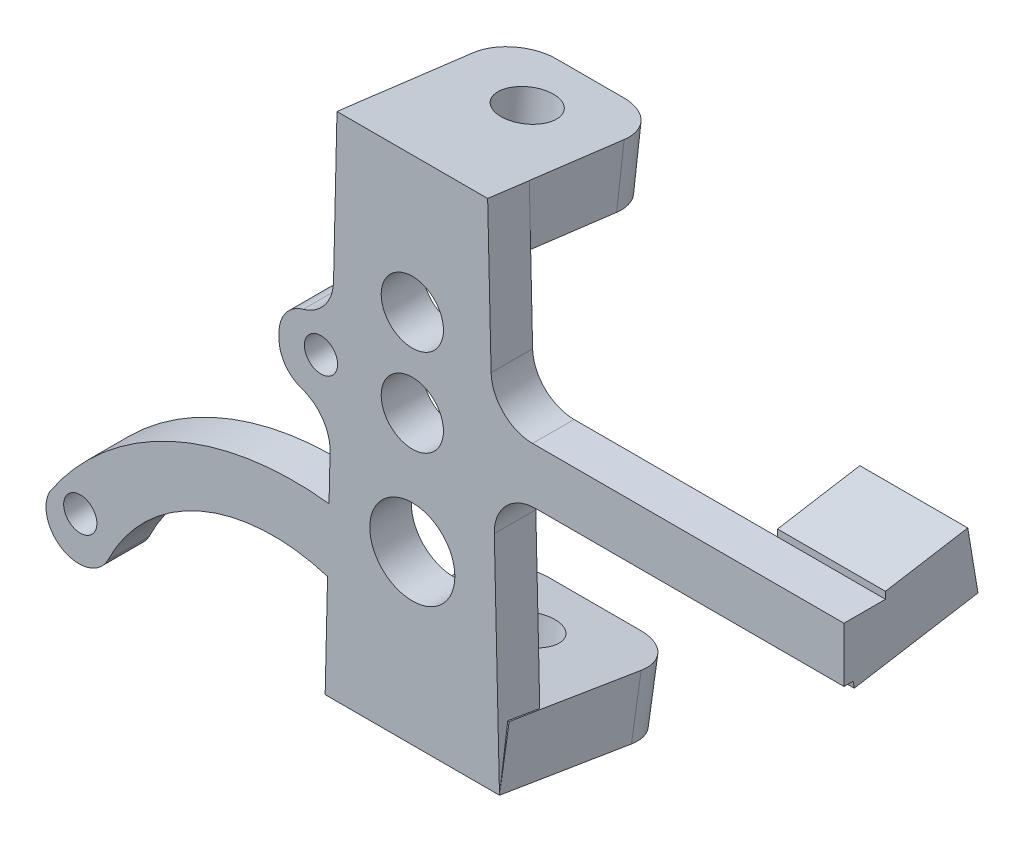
ISO-10303-21;
HEADER;
FILE_DESCRIPTION(('STEP AP214'),'2;1');
FILE_NAME('part.step','',(''),(''),'','','');
FILE_SCHEMA(('AUTOMOTIVE_DESIGN { 1 0 10303 214 1 1 1 1 }'));
ENDSEC;
DATA;
#1=APPLICATION_CONTEXT('core data for automotive mechanical design processes');
#2=APPLICATION_PROTOCOL_DEFINITION('international standard','automotive_design',2000,#1);
#3=PRODUCT_CONTEXT('',#1,'mechanical');
#4=PRODUCT('Part','Part','',(#3));
#5=PRODUCT_RELATED_PRODUCT_CATEGORY('part','',(#4));
#6=PRODUCT_DEFINITION_FORMATION('','',#4);
#7=PRODUCT_DEFINITION_CONTEXT('part definition',#1,'design');
#8=PRODUCT_DEFINITION('design','',#6,#7);
#9=PRODUCT_DEFINITION_SHAPE('','',#8);
#10=(LENGTH_UNIT() NAMED_UNIT(*) SI_UNIT(.MILLI.,.METRE.));
#11=(NAMED_UNIT(*) PLANE_ANGLE_UNIT() SI_UNIT($,.RADIAN.));
#12=(NAMED_UNIT(*) SI_UNIT($,.STERADIAN.) SOLID_ANGLE_UNIT());
#13=UNCERTAINTY_MEASURE_WITH_UNIT(LENGTH_MEASURE(1.E-05),#10,'distance_accuracy_value','');
#14=(GEOMETRIC_REPRESENTATION_CONTEXT(3) GLOBAL_UNCERTAINTY_ASSIGNED_CONTEXT((#13)) GLOBAL_UNIT_ASSIGNED_CONTEXT((#10,
#11,#12)) REPRESENTATION_CONTEXT('',''));
#15=CARTESIAN_POINT('',(0.,0.,0.));
#16=DIRECTION('',(0.,0.,1.));
#17=DIRECTION('',(1.,0.,0.));
#18=AXIS2_PLACEMENT_3D('',#15,#16,#17);
#19=CARTESIAN_POINT('',(104.,0.,-10.));
#20=DIRECTION('',(-1.,0.,0.));
#21=DIRECTION('',(0.,0.,1.));
#22=AXIS2_PLACEMENT_3D('',#19,#20,#21);
#23=PLANE('',#22);
#24=DIRECTION('',(0.,1.,0.));
#25=VECTOR('',#24,1.);
#26=CARTESIAN_POINT('',(104.,0.,-9.99498130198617));
#27=LINE('',#26,#25);
#28=CARTESIAN_POINT('',(104.,37.1,-9.99498130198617));
#29=VERTEX_POINT('',#28);
#30=CARTESIAN_POINT('',(104.,38.7658302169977,-9.99498130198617));
#31=VERTEX_POINT('',#30);
#32=EDGE_CURVE('E847',#29,#31,#27,.T.);
#33=ORIENTED_EDGE('',*,*,#32,.F.);
#34=DIRECTION('',(0.,0.,1.));
#35=VECTOR('',#34,1.);
#36=CARTESIAN_POINT('',(104.,37.1,-10.));
#37=LINE('',#36,#35);
#38=CARTESIAN_POINT('',(104.,37.1,0.));
#39=VERTEX_POINT('',#38);
#40=EDGE_CURVE('E298',#29,#39,#37,.T.);
#41=ORIENTED_EDGE('',*,*,#40,.T.);
#42=DIRECTION('',(0.,-1.,0.));
#43=VECTOR('',#42,1.);
#44=CARTESIAN_POINT('',(104.,0.,0.));
#45=LINE('',#44,#43);
#46=CARTESIAN_POINT('',(104.,23.8996249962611,0.));
#47=VERTEX_POINT('',#46);
#48=EDGE_CURVE('E579',#39,#47,#45,.T.);
#49=ORIENTED_EDGE('',*,*,#48,.T.);
#50=DIRECTION('',(0.,0.,1.));
#51=VECTOR('',#50,1.);
#52=CARTESIAN_POINT('',(104.,23.8996249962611,-10.));
#53=LINE('',#52,#51);
#54=CARTESIAN_POINT('',(104.,23.8996249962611,-2.2000625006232));
#55=VERTEX_POINT('',#54);
#56=EDGE_CURVE('E597',#55,#47,#53,.T.);
#57=ORIENTED_EDGE('',*,*,#56,.F.);
#58=DIRECTION('',(0.,0.986393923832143,0.164398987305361));
#59=VECTOR('',#58,1.);
#60=CARTESIAN_POINT('',(104.,22.3040911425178,-2.46598480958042));
#61=LINE('',#60,#59);
#62=CARTESIAN_POINT('',(104.,22.3040911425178,-2.46598480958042));
#63=VERTEX_POINT('',#62);
#64=EDGE_CURVE('E428',#63,#55,#61,.T.);
#65=ORIENTED_EDGE('',*,*,#64,.F.);
#66=DIRECTION('',(0.,-0.16439898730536,0.986393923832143));
#67=VECTOR('',#66,1.);
#68=CARTESIAN_POINT('',(104.,27.2742006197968,-32.2866416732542));
#69=LINE('',#68,#67);
#70=CARTESIAN_POINT('',(104.,27.2742006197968,-32.2866416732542));
#71=VERTEX_POINT('',#70);
#72=EDGE_CURVE('E395',#71,#63,#69,.T.);
#73=ORIENTED_EDGE('',*,*,#72,.F.);
#74=DIRECTION('',(0.,-0.986393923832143,-0.164398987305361));
#75=VECTOR('',#74,1.);
#76=CARTESIAN_POINT('',(104.,42.070109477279,-29.8206568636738));
#77=LINE('',#76,#75);
#78=CARTESIAN_POINT('',(104.,42.070109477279,-29.8206568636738));
#79=VERTEX_POINT('',#78);
#80=EDGE_CURVE('E403',#79,#71,#77,.T.);
#81=ORIENTED_EDGE('',*,*,#80,.F.);
#82=DIRECTION('',(0.,0.164398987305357,-0.986393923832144));
#83=VECTOR('',#82,1.);
#84=CARTESIAN_POINT('',(104.,42.070109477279,-29.8206568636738));
#85=LINE('',#84,#83);
#86=EDGE_CURVE('E402',#31,#79,#85,.T.);
#87=ORIENTED_EDGE('',*,*,#86,.F.);
#88=EDGE_LOOP('',(#33,#41,#49,#57,#65,#73,#81,#87));
#89=FACE_BOUND('',#88,.T.);
#90=ADVANCED_FACE('F40',(#89),#23,.F.);
#91=CARTESIAN_POINT('',(78.,0.,0.));
#92=DIRECTION('',(1.,0.,0.));
#93=DIRECTION('',(0.,0.,-1.));
#94=AXIS2_PLACEMENT_3D('',#91,#92,#93);
#95=PLANE('',#94);
#96=DIRECTION('',(0.,-1.,0.));
#97=VECTOR('',#96,1.);
#98=CARTESIAN_POINT('',(78.,57.1,-9.99498130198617));
#99=LINE('',#98,#97);
#100=CARTESIAN_POINT('',(78.,38.7658302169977,-9.99498130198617));
#101=VERTEX_POINT('',#100);
#102=CARTESIAN_POINT('',(78.,37.1,-9.99498130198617));
#103=VERTEX_POINT('',#102);
#104=EDGE_CURVE('E290',#101,#103,#99,.T.);
#105=ORIENTED_EDGE('',*,*,#104,.F.);
#106=DIRECTION('',(0.,0.164398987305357,-0.986393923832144));
#107=VECTOR('',#106,1.);
#108=CARTESIAN_POINT('',(78.,42.070109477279,-29.8206568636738));
#109=LINE('',#108,#107);
#110=CARTESIAN_POINT('',(78.,42.070109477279,-29.8206568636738));
#111=VERTEX_POINT('',#110);
#112=EDGE_CURVE('E409',#101,#111,#109,.T.);
#113=ORIENTED_EDGE('',*,*,#112,.T.);
#114=DIRECTION('',(0.,-0.986393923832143,-0.164398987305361));
#115=VECTOR('',#114,1.);
#116=CARTESIAN_POINT('',(78.,42.070109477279,-29.8206568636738));
#117=LINE('',#116,#115);
#118=CARTESIAN_POINT('',(78.,27.2742006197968,-32.2866416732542));
#119=VERTEX_POINT('',#118);
#120=EDGE_CURVE('E406',#111,#119,#117,.T.);
#121=ORIENTED_EDGE('',*,*,#120,.T.);
#122=DIRECTION('',(0.,-0.16439898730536,0.986393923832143));
#123=VECTOR('',#122,1.);
#124=CARTESIAN_POINT('',(78.,27.2742006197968,-32.2866416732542));
#125=LINE('',#124,#123);
#126=CARTESIAN_POINT('',(78.,22.3040911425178,-2.46598480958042));
#127=VERTEX_POINT('',#126);
#128=EDGE_CURVE('E408',#119,#127,#125,.T.);
#129=ORIENTED_EDGE('',*,*,#128,.T.);
#130=DIRECTION('',(0.,0.986393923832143,0.164398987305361));
#131=VECTOR('',#130,1.);
#132=CARTESIAN_POINT('',(78.,22.3040911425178,-2.46598480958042));
#133=LINE('',#132,#131);
#134=CARTESIAN_POINT('',(78.,23.8996249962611,-2.2000625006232));
#135=VERTEX_POINT('',#134);
#136=EDGE_CURVE('E855',#127,#135,#133,.T.);
#137=ORIENTED_EDGE('',*,*,#136,.T.);
#138=DIRECTION('',(0.,0.,-1.));
#139=VECTOR('',#138,1.);
#140=CARTESIAN_POINT('',(78.,23.8996249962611,-10.));
#141=LINE('',#140,#139);
#142=CARTESIAN_POINT('',(78.,23.8996249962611,-10.));
#143=VERTEX_POINT('',#142);
#144=EDGE_CURVE('E396',#135,#143,#141,.T.);
#145=ORIENTED_EDGE('',*,*,#144,.T.);
#146=DIRECTION('',(0.,1.,0.));
#147=VECTOR('',#146,1.);
#148=CARTESIAN_POINT('',(78.,0.,-10.));
#149=LINE('',#148,#147);
#150=CARTESIAN_POINT('',(78.,37.1,-10.));
#151=VERTEX_POINT('',#150);
#152=EDGE_CURVE('E308',#143,#151,#149,.T.);
#153=ORIENTED_EDGE('',*,*,#152,.T.);
#154=DIRECTION('',(0.,0.,-1.));
#155=VECTOR('',#154,1.);
#156=CARTESIAN_POINT('',(78.,37.1,-10.));
#157=LINE('',#156,#155);
#158=EDGE_CURVE('E44',#103,#151,#157,.T.);
#159=ORIENTED_EDGE('',*,*,#158,.F.);
#160=EDGE_LOOP('',(#105,#113,#121,#129,#137,#145,#153,#159));
#161=FACE_BOUND('',#160,.T.);
#162=ADVANCED_FACE('F306',(#161),#95,.F.);
#163=CARTESIAN_POINT('',(104.,42.070109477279,-29.8206568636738));
#164=DIRECTION('',(0.,0.986393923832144,0.164398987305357));
#165=DIRECTION('',(0.,-0.164398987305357,0.986393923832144));
#166=AXIS2_PLACEMENT_3D('',#163,#164,#165);
#167=PLANE('',#166);
#168=ORIENTED_EDGE('',*,*,#112,.F.);
#169=DIRECTION('',(1.,0.,0.));
#170=VECTOR('',#169,1.);
#171=CARTESIAN_POINT('',(104.,38.7658302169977,-9.99498130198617));
#172=LINE('',#171,#170);
#173=EDGE_CURVE('E12',#101,#31,#172,.T.);
#174=ORIENTED_EDGE('',*,*,#173,.T.);
#175=ORIENTED_EDGE('',*,*,#86,.T.);
#176=DIRECTION('',(-1.,0.,0.));
#177=VECTOR('',#176,1.);
#178=CARTESIAN_POINT('',(104.,42.070109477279,-29.8206568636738));
#179=LINE('',#178,#177);
#180=EDGE_CURVE('E417',#79,#111,#179,.T.);
#181=ORIENTED_EDGE('',*,*,#180,.T.);
#182=EDGE_LOOP('',(#168,#174,#175,#181));
#183=FACE_BOUND('',#182,.T.);
#184=ADVANCED_FACE('F724',(#183),#167,.T.);
#185=CARTESIAN_POINT('',(0.,0.,-10.));
#186=DIRECTION('',(0.,0.,1.));
#187=DIRECTION('',(1.,0.,0.));
#188=AXIS2_PLACEMENT_3D('',#185,#186,#187);
#189=PLANE('',#188);
#190=CARTESIAN_POINT('',(0.,28.9324851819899,-10.));
#191=DIRECTION('',(0.,0.,-1.));
#192=DIRECTION('',(-1.,0.,0.));
#193=AXIS2_PLACEMENT_3D('',#190,#191,#192);
#194=CIRCLE('',#193,7.5);
#195=CARTESIAN_POINT('',(-7.5,28.9324851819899,-10.));
#196=VERTEX_POINT('',#195);
#197=EDGE_CURVE('E553',#196,#196,#194,.T.);
#198=ORIENTED_EDGE('',*,*,#197,.F.);
#199=EDGE_LOOP('',(#198));
#200=FACE_BOUND('',#199,.T.);
#201=CARTESIAN_POINT('',(0.,49.9941197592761,-10.));
#202=DIRECTION('',(0.,0.,-1.));
#203=DIRECTION('',(-1.,0.,0.));
#204=AXIS2_PLACEMENT_3D('',#201,#202,#203);
#205=CIRCLE('',#204,7.5);
#206=CARTESIAN_POINT('',(-7.5,49.9941197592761,-10.));
#207=VERTEX_POINT('',#206);
#208=EDGE_CURVE('E543',#207,#207,#205,.T.);
#209=ORIENTED_EDGE('',*,*,#208,.F.);
#210=EDGE_LOOP('',(#209));
#211=FACE_BOUND('',#210,.T.);
#212=CARTESIAN_POINT('',(0.,0.,-10.));
#213=DIRECTION('',(0.,0.,1.));
#214=DIRECTION('',(1.,0.,0.));
#215=AXIS2_PLACEMENT_3D('',#212,#213,#214);
#216=CIRCLE('',#215,10.25);
#217=CARTESIAN_POINT('',(10.25,0.,-10.));
#218=VERTEX_POINT('',#217);
#219=EDGE_CURVE('E447',#218,#218,#216,.T.);
#220=ORIENTED_EDGE('',*,*,#219,.T.);
#221=EDGE_LOOP('',(#220));
#222=FACE_BOUND('',#221,.T.);
#223=CARTESIAN_POINT('',(-29.8091987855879,11.25,-10.));
#224=DIRECTION('',(0.,0.,1.));
#225=DIRECTION('',(1.,0.,0.));
#226=AXIS2_PLACEMENT_3D('',#223,#224,#225);
#227=CIRCLE('',#226,10.);
#228=CARTESIAN_POINT('',(-19.8118777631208,11.0185429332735,-10.));
#229=VERTEX_POINT('',#228);
#230=CARTESIAN_POINT('',(-26.6421198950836,20.7352312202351,-10.));
#231=VERTEX_POINT('',#230);
#232=EDGE_CURVE('E516',#229,#231,#227,.T.);
#233=ORIENTED_EDGE('',*,*,#232,.T.);
#234=CARTESIAN_POINT('',(-24.1084567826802,28.3234161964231,-10.));
#235=DIRECTION('',(0.,0.,1.));
#236=DIRECTION('',(1.,0.,0.));
#237=AXIS2_PLACEMENT_3D('',#234,#235,#236);
#238=CIRCLE('',#237,8.);
#239=CARTESIAN_POINT('',(-32.1084567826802,28.3234161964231,-10.));
#240=VERTEX_POINT('',#239);
#241=EDGE_CURVE('E538',#231,#240,#238,.F.);
#242=ORIENTED_EDGE('',*,*,#241,.T.);
#243=DIRECTION('',(0.,-1.,0.));
#244=VECTOR('',#243,1.);
#245=CARTESIAN_POINT('',(-32.1084567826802,0.,-10.));
#246=LINE('',#245,#244);
#247=CARTESIAN_POINT('',(-32.1084567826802,29.7715311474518,-10.));
#248=VERTEX_POINT('',#247);
#249=EDGE_CURVE('E586',#248,#240,#246,.T.);
#250=ORIENTED_EDGE('',*,*,#249,.F.);
#251=CARTESIAN_POINT('',(-24.1084567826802,29.7715311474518,-10.));
#252=DIRECTION('',(0.,0.,1.));
#253=DIRECTION('',(1.,0.,0.));
#254=AXIS2_PLACEMENT_3D('',#251,#252,#253);
#255=CIRCLE('',#254,8.);
#256=CARTESIAN_POINT('',(-26.2732328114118,37.4730728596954,-10.));
#257=VERTEX_POINT('',#256);
#258=EDGE_CURVE('E57',#248,#257,#255,.F.);
#259=ORIENTED_EDGE('',*,*,#258,.T.);
#260=CARTESIAN_POINT('',(-28.9792028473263,47.1,-10.));
#261=DIRECTION('',(0.,0.,1.));
#262=DIRECTION('',(1.,0.,0.));
#263=AXIS2_PLACEMENT_3D('',#260,#261,#262);
#264=CIRCLE('',#263,10.);
#265=CARTESIAN_POINT('',(-18.9818818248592,46.8685429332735,-10.));
#266=VERTEX_POINT('',#265);
#267=EDGE_CURVE('E521',#257,#266,#264,.T.);
#268=ORIENTED_EDGE('',*,*,#267,.T.);
#269=DIRECTION('',(-0.0231457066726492,-0.999732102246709,0.));
#270=VECTOR('',#269,1.);
#271=CARTESIAN_POINT('',(-20.0562277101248,0.464339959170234,-10.));
#272=LINE('',#271,#270);
#273=CARTESIAN_POINT('',(-18.1792087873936,81.5383853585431,-10.));
#274=VERTEX_POINT('',#273);
#275=EDGE_CURVE('E340',#274,#266,#272,.T.);
#276=ORIENTED_EDGE('',*,*,#275,.F.);
#277=DIRECTION('',(1.,0.,0.));
#278=VECTOR('',#277,1.);
#279=CARTESIAN_POINT('',(0.,81.5383853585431,-10.));
#280=LINE('',#279,#278);
#281=CARTESIAN_POINT('',(-18.15,81.5383853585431,-10.));
#282=VERTEX_POINT('',#281);
#283=EDGE_CURVE('E574',#274,#282,#280,.T.);
#284=ORIENTED_EDGE('',*,*,#283,.T.);
#285=DIRECTION('',(0.,-1.,0.));
#286=VECTOR('',#285,1.);
#287=CARTESIAN_POINT('',(-18.15,0.,-10.));
#288=LINE('',#287,#286);
#289=CARTESIAN_POINT('',(-18.15,67.0242374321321,-10.));
#290=VERTEX_POINT('',#289);
#291=EDGE_CURVE('E450',#282,#290,#288,.T.);
#292=ORIENTED_EDGE('',*,*,#291,.T.);
#293=DIRECTION('',(-1.,0.,0.));
#294=VECTOR('',#293,1.);
#295=CARTESIAN_POINT('',(0.,67.0242374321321,-10.));
#296=LINE('',#295,#294);
#297=CARTESIAN_POINT('',(18.15,67.0242374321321,-10.));
#298=VERTEX_POINT('',#297);
#299=EDGE_CURVE('E379',#298,#290,#296,.T.);
#300=ORIENTED_EDGE('',*,*,#299,.F.);
#301=DIRECTION('',(0.,-1.,0.));
#302=VECTOR('',#301,1.);
#303=CARTESIAN_POINT('',(18.15,0.,-10.));
#304=LINE('',#303,#302);
#305=CARTESIAN_POINT('',(18.15,81.5383853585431,-10.));
#306=VERTEX_POINT('',#305);
#307=EDGE_CURVE('E383',#306,#298,#304,.T.);
#308=ORIENTED_EDGE('',*,*,#307,.F.);
#309=CARTESIAN_POINT('',(18.1792087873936,81.5383853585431,-10.));
#310=VERTEX_POINT('',#309);
#311=EDGE_CURVE('E571',#306,#310,#280,.T.);
#312=ORIENTED_EDGE('',*,*,#311,.T.);
#313=DIRECTION('',(-0.0231457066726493,0.999732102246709,0.));
#314=VECTOR('',#313,1.);
#315=CARTESIAN_POINT('',(20.0562277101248,0.464339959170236,-10.));
#316=LINE('',#315,#314);
#317=CARTESIAN_POINT('',(18.9818818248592,46.8685429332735,-10.));
#318=VERTEX_POINT('',#317);
#319=EDGE_CURVE('E582',#318,#310,#316,.T.);
#320=ORIENTED_EDGE('',*,*,#319,.F.);
#321=CARTESIAN_POINT('',(28.9792028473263,47.1,-10.));
#322=DIRECTION('',(0.,0.,1.));
#323=DIRECTION('',(1.,0.,0.));
#324=AXIS2_PLACEMENT_3D('',#321,#322,#323);
#325=CIRCLE('',#324,10.);
#326=CARTESIAN_POINT('',(28.9792028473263,37.1,-10.));
#327=VERTEX_POINT('',#326);
#328=EDGE_CURVE('E525',#318,#327,#325,.T.);
#329=ORIENTED_EDGE('',*,*,#328,.T.);
#330=DIRECTION('',(-1.,0.,0.));
#331=VECTOR('',#330,1.);
#332=CARTESIAN_POINT('',(0.,37.1,-10.));
#333=LINE('',#332,#331);
#334=EDGE_CURVE('E310',#151,#327,#333,.T.);
#335=ORIENTED_EDGE('',*,*,#334,.F.);
#336=ORIENTED_EDGE('',*,*,#152,.F.);
#337=DIRECTION('',(-1.,0.,0.));
#338=VECTOR('',#337,1.);
#339=CARTESIAN_POINT('',(0.,23.8996249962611,-10.));
#340=LINE('',#339,#338);
#341=CARTESIAN_POINT('',(29.7478549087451,23.8996249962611,-10.));
#342=VERTEX_POINT('',#341);
#343=EDGE_CURVE('E321',#143,#342,#340,.T.);
#344=ORIENTED_EDGE('',*,*,#343,.T.);
#345=CARTESIAN_POINT('',(29.7478549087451,13.8996249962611,-10.));
#346=DIRECTION('',(0.,0.,1.));
#347=DIRECTION('',(1.,0.,0.));
#348=AXIS2_PLACEMENT_3D('',#345,#346,#347);
#349=CIRCLE('',#348,10.);
#350=CARTESIAN_POINT('',(19.750533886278,13.6681679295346,-10.));
#351=VERTEX_POINT('',#350);
#352=EDGE_CURVE('E512',#342,#351,#349,.T.);
#353=ORIENTED_EDGE('',*,*,#352,.T.);
#354=DIRECTION('',(-0.0231457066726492,0.999732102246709,0.));
#355=VECTOR('',#354,1.);
#356=CARTESIAN_POINT('',(20.0562277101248,0.464339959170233,-10.));
#357=LINE('',#356,#355);
#358=CARTESIAN_POINT('',(20.7000430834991,-27.3439661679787,-10.));
#359=VERTEX_POINT('',#358);
#360=EDGE_CURVE('E325',#359,#351,#357,.T.);
#361=ORIENTED_EDGE('',*,*,#360,.F.);
#362=DIRECTION('',(-1.,0.,0.));
#363=VECTOR('',#362,1.);
#364=CARTESIAN_POINT('',(0.,-27.3439661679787,-10.));
#365=LINE('',#364,#363);
#366=CARTESIAN_POINT('',(-20.7000430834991,-27.3439661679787,-10.));
#367=VERTEX_POINT('',#366);
#368=EDGE_CURVE('E314',#359,#367,#365,.T.);
#369=ORIENTED_EDGE('',*,*,#368,.T.);
#370=CARTESIAN_POINT('',(-20.4224806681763,-15.3552176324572,-10.));
#371=VERTEX_POINT('',#370);
#372=EDGE_CURVE('E341',#371,#367,#272,.T.);
#373=ORIENTED_EDGE('',*,*,#372,.F.);
#374=CARTESIAN_POINT('',(-33.4817591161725,-57.6573825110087,-10.));
#375=DIRECTION('',(0.,0.,1.));
#376=DIRECTION('',(1.,0.,0.));
#377=AXIS2_PLACEMENT_3D('',#374,#375,#376);
#378=CIRCLE('',#377,44.272089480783);
#379=CARTESIAN_POINT('',(-73.3675020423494,-38.4442250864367,-10.));
#380=VERTEX_POINT('',#379);
#381=EDGE_CURVE('E311',#371,#380,#378,.T.);
#382=ORIENTED_EDGE('',*,*,#381,.T.);
#383=CARTESIAN_POINT('',(-80.3571542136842,-34.7658525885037,-10.));
#384=DIRECTION('',(0.,0.,1.));
#385=DIRECTION('',(1.,0.,0.));
#386=AXIS2_PLACEMENT_3D('',#383,#384,#385);
#387=CIRCLE('',#386,7.89845945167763);
#388=CARTESIAN_POINT('',(-87.3468063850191,-31.0874800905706,-10.));
#389=VERTEX_POINT('',#388);
#390=EDGE_CURVE('E327',#389,#380,#387,.T.);
#391=ORIENTED_EDGE('',*,*,#390,.F.);
#392=CARTESIAN_POINT('',(-28.5144262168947,-70.0655212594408,-10.));
#393=DIRECTION('',(0.,0.,1.));
#394=DIRECTION('',(1.,0.,0.));
#395=AXIS2_PLACEMENT_3D('',#392,#393,#394);
#396=CIRCLE('',#395,70.5729172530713);
#397=CARTESIAN_POINT('',(-20.0669780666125,0.,-10.));
#398=VERTEX_POINT('',#397);
#399=EDGE_CURVE('E332',#398,#389,#396,.T.);
#400=ORIENTED_EDGE('',*,*,#399,.F.);
#401=EDGE_CURVE('E336',#229,#398,#272,.T.);
#402=ORIENTED_EDGE('',*,*,#401,.F.);
#403=EDGE_LOOP('',(#233,#242,#250,#259,#268,#276,#284,#292,#300,#308,#312,#320,#329,#335,#336,
#344,#353,#361,#369,#373,#382,#391,#400,#402));
#404=FACE_BOUND('',#403,.T.);
#405=CARTESIAN_POINT('',(-22.,30.1,-10.));
#406=DIRECTION('',(0.,0.,1.));
#407=DIRECTION('',(1.,0.,0.));
#408=AXIS2_PLACEMENT_3D('',#405,#406,#407);
#409=CIRCLE('',#408,4.);
#410=CARTESIAN_POINT('',(-18.,30.1,-10.));
#411=VERTEX_POINT('',#410);
#412=EDGE_CURVE('E620',#411,#411,#409,.T.);
#413=ORIENTED_EDGE('',*,*,#412,.T.);
#414=EDGE_LOOP('',(#413));
#415=FACE_BOUND('',#414,.T.);
#416=CARTESIAN_POINT('',(-80.,-32.1,-10.));
#417=DIRECTION('',(0.,0.,1.));
#418=DIRECTION('',(1.,0.,0.));
#419=AXIS2_PLACEMENT_3D('',#416,#417,#418);
#420=CIRCLE('',#419,4.00000000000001);
#421=CARTESIAN_POINT('',(-76.,-32.1,-10.));
#422=VERTEX_POINT('',#421);
#423=EDGE_CURVE('E617',#422,#422,#420,.T.);
#424=ORIENTED_EDGE('',*,*,#423,.T.);
#425=EDGE_LOOP('',(#424));
#426=FACE_BOUND('',#425,.T.);
#427=ADVANCED_FACE('F628',(#200,#211,#222,#404,#415,#426),#189,.F.);
#428=CARTESIAN_POINT('',(0.,37.1,-10.));
#429=DIRECTION('',(0.,1.,0.));
#430=DIRECTION('',(-1.,0.,0.));
#431=AXIS2_PLACEMENT_3D('',#428,#429,#430);
#432=PLANE('',#431);
#433=ORIENTED_EDGE('',*,*,#334,.T.);
#434=DIRECTION('',(0.,0.,1.));
#435=VECTOR('',#434,1.);
#436=CARTESIAN_POINT('',(28.9792028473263,37.1,0.));
#437=LINE('',#436,#435);
#438=CARTESIAN_POINT('',(28.9792028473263,37.1,0.));
#439=VERTEX_POINT('',#438);
#440=EDGE_CURVE('E505',#327,#439,#437,.T.);
#441=ORIENTED_EDGE('',*,*,#440,.T.);
#442=DIRECTION('',(-1.,0.,0.));
#443=VECTOR('',#442,1.);
#444=CARTESIAN_POINT('',(0.,37.1,0.));
#445=LINE('',#444,#443);
#446=EDGE_CURVE('E583',#39,#439,#445,.T.);
#447=ORIENTED_EDGE('',*,*,#446,.F.);
#448=ORIENTED_EDGE('',*,*,#40,.F.);
#449=DIRECTION('',(-1.,0.,0.));
#450=VECTOR('',#449,1.);
#451=CARTESIAN_POINT('',(78.,37.1,-9.99498130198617));
#452=LINE('',#451,#450);
#453=EDGE_CURVE('E293',#29,#103,#452,.T.);
#454=ORIENTED_EDGE('',*,*,#453,.T.);
#455=ORIENTED_EDGE('',*,*,#158,.T.);
#456=EDGE_LOOP('',(#433,#441,#447,#448,#454,#455));
#457=FACE_BOUND('',#456,.T.);
#458=ADVANCED_FACE('F302',(#457),#432,.T.);
#459=CARTESIAN_POINT('',(0.,23.8996249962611,-10.));
#460=DIRECTION('',(0.,1.,0.));
#461=DIRECTION('',(-1.,0.,0.));
#462=AXIS2_PLACEMENT_3D('',#459,#460,#461);
#463=PLANE('',#462);
#464=DIRECTION('',(-1.,0.,0.));
#465=VECTOR('',#464,1.);
#466=CARTESIAN_POINT('',(0.,23.8996249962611,0.));
#467=LINE('',#466,#465);
#468=CARTESIAN_POINT('',(29.7478549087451,23.8996249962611,0.));
#469=VERTEX_POINT('',#468);
#470=EDGE_CURVE('E594',#47,#469,#467,.T.);
#471=ORIENTED_EDGE('',*,*,#470,.T.);
#472=DIRECTION('',(0.,0.,1.));
#473=VECTOR('',#472,1.);
#474=CARTESIAN_POINT('',(29.7478549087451,23.8996249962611,-10.));
#475=LINE('',#474,#473);
#476=EDGE_CURVE('E498',#469,#342,#475,.F.);
#477=ORIENTED_EDGE('',*,*,#476,.T.);
#478=ORIENTED_EDGE('',*,*,#343,.F.);
#479=ORIENTED_EDGE('',*,*,#144,.F.);
#480=DIRECTION('',(1.,0.,0.));
#481=VECTOR('',#480,1.);
#482=CARTESIAN_POINT('',(0.,23.8996249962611,-2.2000625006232));
#483=LINE('',#482,#481);
#484=EDGE_CURVE('E312',#135,#55,#483,.T.);
#485=ORIENTED_EDGE('',*,*,#484,.T.);
#486=ORIENTED_EDGE('',*,*,#56,.T.);
#487=EDGE_LOOP('',(#471,#477,#478,#479,#485,#486));
#488=FACE_BOUND('',#487,.T.);
#489=ADVANCED_FACE('F728',(#488),#463,.F.);
#490=CARTESIAN_POINT('',(0.,0.,0.));
#491=DIRECTION('',(0.,0.,1.));
#492=DIRECTION('',(1.,0.,0.));
#493=AXIS2_PLACEMENT_3D('',#490,#491,#492);
#494=PLANE('',#493);
#495=CARTESIAN_POINT('',(0.,28.9324851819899,0.));
#496=DIRECTION('',(0.,0.,1.));
#497=DIRECTION('',(1.,0.,0.));
#498=AXIS2_PLACEMENT_3D('',#495,#496,#497);
#499=CIRCLE('',#498,7.5);
#500=CARTESIAN_POINT('',(7.5,28.9324851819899,0.));
#501=VERTEX_POINT('',#500);
#502=EDGE_CURVE('E429',#501,#501,#499,.T.);
#503=ORIENTED_EDGE('',*,*,#502,.F.);
#504=EDGE_LOOP('',(#503));
#505=FACE_BOUND('',#504,.T.);
#506=CARTESIAN_POINT('',(0.,49.9941197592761,0.));
#507=DIRECTION('',(0.,0.,1.));
#508=DIRECTION('',(1.,0.,0.));
#509=AXIS2_PLACEMENT_3D('',#506,#507,#508);
#510=CIRCLE('',#509,7.5);
#511=CARTESIAN_POINT('',(7.5,49.9941197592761,0.));
#512=VERTEX_POINT('',#511);
#513=EDGE_CURVE('E541',#512,#512,#510,.T.);
#514=ORIENTED_EDGE('',*,*,#513,.F.);
#515=EDGE_LOOP('',(#514));
#516=FACE_BOUND('',#515,.T.);
#517=DIRECTION('',(0.,-1.,0.));
#518=VECTOR('',#517,1.);
#519=CARTESIAN_POINT('',(-32.1084567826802,0.,0.));
#520=LINE('',#519,#518);
#521=CARTESIAN_POINT('',(-32.1084567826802,29.7715311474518,0.));
#522=VERTEX_POINT('',#521);
#523=CARTESIAN_POINT('',(-32.1084567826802,28.3234161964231,0.));
#524=VERTEX_POINT('',#523);
#525=EDGE_CURVE('E615',#522,#524,#520,.T.);
#526=ORIENTED_EDGE('',*,*,#525,.T.);
#527=CARTESIAN_POINT('',(-24.1084567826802,28.3234161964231,0.));
#528=DIRECTION('',(0.,0.,1.));
#529=DIRECTION('',(1.,0.,0.));
#530=AXIS2_PLACEMENT_3D('',#527,#528,#529);
#531=CIRCLE('',#530,8.);
#532=CARTESIAN_POINT('',(-26.6421198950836,20.7352312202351,0.));
#533=VERTEX_POINT('',#532);
#534=EDGE_CURVE('E534',#524,#533,#531,.T.);
#535=ORIENTED_EDGE('',*,*,#534,.T.);
#536=CARTESIAN_POINT('',(-29.8091987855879,11.25,0.));
#537=DIRECTION('',(0.,0.,1.));
#538=DIRECTION('',(1.,0.,0.));
#539=AXIS2_PLACEMENT_3D('',#536,#537,#538);
#540=CIRCLE('',#539,10.);
#541=CARTESIAN_POINT('',(-19.8118777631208,11.0185429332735,0.));
#542=VERTEX_POINT('',#541);
#543=EDGE_CURVE('E514',#533,#542,#540,.F.);
#544=ORIENTED_EDGE('',*,*,#543,.T.);
#545=DIRECTION('',(-0.0231457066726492,-0.999732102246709,0.));
#546=VECTOR('',#545,1.);
#547=CARTESIAN_POINT('',(-20.0562277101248,0.464339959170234,0.));
#548=LINE('',#547,#546);
#549=CARTESIAN_POINT('',(-20.0669780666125,0.,0.));
#550=VERTEX_POINT('',#549);
#551=EDGE_CURVE('E613',#542,#550,#548,.T.);
#552=ORIENTED_EDGE('',*,*,#551,.T.);
#553=CARTESIAN_POINT('',(-28.5144262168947,-70.0655212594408,0.));
#554=DIRECTION('',(0.,0.,1.));
#555=DIRECTION('',(1.,0.,0.));
#556=AXIS2_PLACEMENT_3D('',#553,#554,#555);
#557=CIRCLE('',#556,70.5729172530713);
#558=CARTESIAN_POINT('',(-87.3468063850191,-31.0874800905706,0.));
#559=VERTEX_POINT('',#558);
#560=EDGE_CURVE('E610',#550,#559,#557,.T.);
#561=ORIENTED_EDGE('',*,*,#560,.T.);
#562=CARTESIAN_POINT('',(-80.3571542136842,-34.7658525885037,0.));
#563=DIRECTION('',(0.,0.,1.));
#564=DIRECTION('',(1.,0.,0.));
#565=AXIS2_PLACEMENT_3D('',#562,#563,#564);
#566=CIRCLE('',#565,7.89845945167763);
#567=CARTESIAN_POINT('',(-73.3675020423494,-38.4442250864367,0.));
#568=VERTEX_POINT('',#567);
#569=EDGE_CURVE('E607',#559,#568,#566,.T.);
#570=ORIENTED_EDGE('',*,*,#569,.T.);
#571=CARTESIAN_POINT('',(-33.4817591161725,-57.6573825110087,0.));
#572=DIRECTION('',(0.,0.,1.));
#573=DIRECTION('',(1.,0.,0.));
#574=AXIS2_PLACEMENT_3D('',#571,#572,#573);
#575=CIRCLE('',#574,44.272089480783);
#576=CARTESIAN_POINT('',(-20.4224806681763,-15.3552176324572,0.));
#577=VERTEX_POINT('',#576);
#578=EDGE_CURVE('E604',#577,#568,#575,.T.);
#579=ORIENTED_EDGE('',*,*,#578,.F.);
#580=CARTESIAN_POINT('',(-21.,-40.3,0.));
#581=VERTEX_POINT('',#580);
#582=EDGE_CURVE('E603',#577,#581,#548,.T.);
#583=ORIENTED_EDGE('',*,*,#582,.T.);
#584=DIRECTION('',(1.,0.,0.));
#585=VECTOR('',#584,1.);
#586=CARTESIAN_POINT('',(0.,-40.3,0.));
#587=LINE('',#586,#585);
#588=CARTESIAN_POINT('',(21.,-40.3,0.));
#589=VERTEX_POINT('',#588);
#590=EDGE_CURVE('E600',#581,#589,#587,.T.);
#591=ORIENTED_EDGE('',*,*,#590,.T.);
#592=DIRECTION('',(-0.0231457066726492,0.999732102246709,0.));
#593=VECTOR('',#592,1.);
#594=CARTESIAN_POINT('',(20.0562277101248,0.464339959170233,0.));
#595=LINE('',#594,#593);
#596=CARTESIAN_POINT('',(19.750533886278,13.6681679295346,0.));
#597=VERTEX_POINT('',#596);
#598=EDGE_CURVE('E587',#589,#597,#595,.T.);
#599=ORIENTED_EDGE('',*,*,#598,.T.);
#600=CARTESIAN_POINT('',(29.7478549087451,13.8996249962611,0.));
#601=DIRECTION('',(0.,0.,1.));
#602=DIRECTION('',(1.,0.,0.));
#603=AXIS2_PLACEMENT_3D('',#600,#601,#602);
#604=CIRCLE('',#603,10.);
#605=EDGE_CURVE('E510',#597,#469,#604,.F.);
#606=ORIENTED_EDGE('',*,*,#605,.T.);
#607=ORIENTED_EDGE('',*,*,#470,.F.);
#608=ORIENTED_EDGE('',*,*,#48,.F.);
#609=ORIENTED_EDGE('',*,*,#446,.T.);
#610=CARTESIAN_POINT('',(28.9792028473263,47.1,0.));
#611=DIRECTION('',(0.,0.,1.));
#612=DIRECTION('',(1.,0.,0.));
#613=AXIS2_PLACEMENT_3D('',#610,#611,#612);
#614=CIRCLE('',#613,10.);
#615=CARTESIAN_POINT('',(18.9818818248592,46.8685429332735,0.));
#616=VERTEX_POINT('',#615);
#617=EDGE_CURVE('E523',#439,#616,#614,.F.);
#618=ORIENTED_EDGE('',*,*,#617,.T.);
#619=DIRECTION('',(-0.0231457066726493,0.999732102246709,0.));
#620=VECTOR('',#619,1.);
#621=CARTESIAN_POINT('',(20.0562277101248,0.464339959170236,0.));
#622=LINE('',#621,#620);
#623=CARTESIAN_POINT('',(18.15,82.8,0.));
#624=VERTEX_POINT('',#623);
#625=EDGE_CURVE('E592',#616,#624,#622,.T.);
#626=ORIENTED_EDGE('',*,*,#625,.T.);
#627=DIRECTION('',(-1.,0.,0.));
#628=VECTOR('',#627,1.);
#629=CARTESIAN_POINT('',(0.,82.8,0.));
#630=LINE('',#629,#628);
#631=CARTESIAN_POINT('',(-18.15,82.8,0.));
#632=VERTEX_POINT('',#631);
#633=EDGE_CURVE('E387',#624,#632,#630,.T.);
#634=ORIENTED_EDGE('',*,*,#633,.T.);
#635=CARTESIAN_POINT('',(-18.9818818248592,46.8685429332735,0.));
#636=VERTEX_POINT('',#635);
#637=EDGE_CURVE('E616',#632,#636,#548,.T.);
#638=ORIENTED_EDGE('',*,*,#637,.T.);
#639=CARTESIAN_POINT('',(-28.9792028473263,47.1,0.));
#640=DIRECTION('',(0.,0.,1.));
#641=DIRECTION('',(1.,0.,0.));
#642=AXIS2_PLACEMENT_3D('',#639,#640,#641);
#643=CIRCLE('',#642,10.);
#644=CARTESIAN_POINT('',(-26.2732328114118,37.4730728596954,0.));
#645=VERTEX_POINT('',#644);
#646=EDGE_CURVE('E518',#636,#645,#643,.F.);
#647=ORIENTED_EDGE('',*,*,#646,.T.);
#648=CARTESIAN_POINT('',(-24.1084567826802,29.7715311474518,0.));
#649=DIRECTION('',(0.,0.,1.));
#650=DIRECTION('',(1.,0.,0.));
#651=AXIS2_PLACEMENT_3D('',#648,#649,#650);
#652=CIRCLE('',#651,8.);
#653=EDGE_CURVE('E532',#645,#522,#652,.T.);
#654=ORIENTED_EDGE('',*,*,#653,.T.);
#655=EDGE_LOOP('',(#526,#535,#544,#552,#561,#570,#579,#583,#591,#599,#606,#607,#608,#609,#618,
#626,#634,#638,#647,#654));
#656=FACE_BOUND('',#655,.T.);
#657=CARTESIAN_POINT('',(-80.,-32.1,0.));
#658=DIRECTION('',(0.,0.,1.));
#659=DIRECTION('',(1.,0.,0.));
#660=AXIS2_PLACEMENT_3D('',#657,#658,#659);
#661=CIRCLE('',#660,4.00000000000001);
#662=CARTESIAN_POINT('',(-76.,-32.1,0.));
#663=VERTEX_POINT('',#662);
#664=EDGE_CURVE('E355',#663,#663,#661,.T.);
#665=ORIENTED_EDGE('',*,*,#664,.F.);
#666=EDGE_LOOP('',(#665));
#667=FACE_BOUND('',#666,.T.);
#668=CARTESIAN_POINT('',(-22.,30.1,0.));
#669=DIRECTION('',(0.,0.,1.));
#670=DIRECTION('',(1.,0.,0.));
#671=AXIS2_PLACEMENT_3D('',#668,#669,#670);
#672=CIRCLE('',#671,4.);
#673=CARTESIAN_POINT('',(-18.,30.1,0.));
#674=VERTEX_POINT('',#673);
#675=EDGE_CURVE('E339',#674,#674,#672,.T.);
#676=ORIENTED_EDGE('',*,*,#675,.F.);
#677=EDGE_LOOP('',(#676));
#678=FACE_BOUND('',#677,.T.);
#679=CARTESIAN_POINT('',(0.,0.,0.));
#680=DIRECTION('',(0.,0.,1.));
#681=DIRECTION('',(1.,0.,0.));
#682=AXIS2_PLACEMENT_3D('',#679,#680,#681);
#683=CIRCLE('',#682,10.25);
#684=CARTESIAN_POINT('',(10.25,0.,0.));
#685=VERTEX_POINT('',#684);
#686=EDGE_CURVE('E420',#685,#685,#683,.T.);
#687=ORIENTED_EDGE('',*,*,#686,.F.);
#688=EDGE_LOOP('',(#687));
#689=FACE_BOUND('',#688,.T.);
#690=ADVANCED_FACE('F645',(#505,#516,#656,#667,#678,#689),#494,.T.);
#691=CARTESIAN_POINT('',(-32.1084567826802,0.,-10.));
#692=DIRECTION('',(-1.,0.,0.));
#693=DIRECTION('',(0.,0.,1.));
#694=AXIS2_PLACEMENT_3D('',#691,#692,#693);
#695=PLANE('',#694);
#696=ORIENTED_EDGE('',*,*,#249,.T.);
#697=DIRECTION('',(0.,0.,1.));
#698=VECTOR('',#697,1.);
#699=CARTESIAN_POINT('',(-32.1084567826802,28.3234161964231,0.));
#700=LINE('',#699,#698);
#701=EDGE_CURVE('E529',#240,#524,#700,.T.);
#702=ORIENTED_EDGE('',*,*,#701,.T.);
#703=ORIENTED_EDGE('',*,*,#525,.F.);
#704=DIRECTION('',(0.,0.,1.));
#705=VECTOR('',#704,1.);
#706=CARTESIAN_POINT('',(-32.1084567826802,29.7715311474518,-10.));
#707=LINE('',#706,#705);
#708=EDGE_CURVE('E527',#522,#248,#707,.F.);
#709=ORIENTED_EDGE('',*,*,#708,.T.);
#710=EDGE_LOOP('',(#696,#702,#703,#709));
#711=FACE_BOUND('',#710,.T.);
#712=ADVANCED_FACE('F705',(#711),#695,.T.);
#713=CARTESIAN_POINT('',(-20.0562277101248,0.464339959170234,-10.));
#714=DIRECTION('',(-0.999732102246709,0.0231457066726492,0.));
#715=DIRECTION('',(-0.0231457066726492,-0.999732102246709,0.));
#716=AXIS2_PLACEMENT_3D('',#713,#714,#715);
#717=PLANE('',#716);
#718=ORIENTED_EDGE('',*,*,#275,.T.);
#719=DIRECTION('',(0.,0.,1.));
#720=VECTOR('',#719,1.);
#721=CARTESIAN_POINT('',(-18.9818818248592,46.8685429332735,0.));
#722=LINE('',#721,#720);
#723=EDGE_CURVE('E502',#266,#636,#722,.T.);
#724=ORIENTED_EDGE('',*,*,#723,.T.);
#725=ORIENTED_EDGE('',*,*,#637,.F.);
#726=DIRECTION('',(0.00289789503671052,0.125168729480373,0.992131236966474));
#727=VECTOR('',#726,1.);
#728=CARTESIAN_POINT('',(-18.2086322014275,80.2675003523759,-20.0734801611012));
#729=LINE('',#728,#727);
#730=EDGE_CURVE('E451',#274,#632,#729,.T.);
#731=ORIENTED_EDGE('',*,*,#730,.F.);
#732=EDGE_LOOP('',(#718,#724,#725,#731));
#733=FACE_BOUND('',#732,.T.);
#734=ADVANCED_FACE('F696',(#733),#717,.T.);
#735=CARTESIAN_POINT('',(20.0562277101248,0.464339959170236,-10.));
#736=DIRECTION('',(0.999732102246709,0.0231457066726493,0.));
#737=DIRECTION('',(-0.0231457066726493,0.999732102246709,0.));
#738=AXIS2_PLACEMENT_3D('',#735,#736,#737);
#739=PLANE('',#738);
#740=ORIENTED_EDGE('',*,*,#625,.F.);
#741=DIRECTION('',(0.,0.,1.));
#742=VECTOR('',#741,1.);
#743=CARTESIAN_POINT('',(18.9818818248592,46.8685429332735,-10.));
#744=LINE('',#743,#742);
#745=EDGE_CURVE('E508',#616,#318,#744,.F.);
#746=ORIENTED_EDGE('',*,*,#745,.T.);
#747=ORIENTED_EDGE('',*,*,#319,.T.);
#748=DIRECTION('',(0.00289789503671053,-0.125168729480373,-0.992131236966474));
#749=VECTOR('',#748,1.);
#750=CARTESIAN_POINT('',(18.2086322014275,80.2675003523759,-20.0734801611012));
#751=LINE('',#750,#749);
#752=EDGE_CURVE('E568',#624,#310,#751,.T.);
#753=ORIENTED_EDGE('',*,*,#752,.F.);
#754=EDGE_LOOP('',(#740,#746,#747,#753));
#755=FACE_BOUND('',#754,.T.);
#756=ADVANCED_FACE('F732',(#755),#739,.T.);
#757=CARTESIAN_POINT('',(20.0562277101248,0.464339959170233,-10.));
#758=DIRECTION('',(0.999732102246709,0.0231457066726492,0.));
#759=DIRECTION('',(-0.0231457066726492,0.999732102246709,0.));
#760=AXIS2_PLACEMENT_3D('',#757,#758,#759);
#761=PLANE('',#760);
#762=ORIENTED_EDGE('',*,*,#360,.T.);
#763=DIRECTION('',(0.,0.,1.));
#764=VECTOR('',#763,1.);
#765=CARTESIAN_POINT('',(19.750533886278,13.6681679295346,-10.));
#766=LINE('',#765,#764);
#767=EDGE_CURVE('E495',#351,#597,#766,.T.);
#768=ORIENTED_EDGE('',*,*,#767,.T.);
#769=ORIENTED_EDGE('',*,*,#598,.F.);
#770=DIRECTION('',(0.0228424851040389,-0.9866350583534,0.161336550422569));
#771=VECTOR('',#770,1.);
#772=CARTESIAN_POINT('',(20.0439403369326,0.99506825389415,-6.7526526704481));
#773=LINE('',#772,#771);
#774=CARTESIAN_POINT('',(20.6709823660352,-26.0887471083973,-2.32385267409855));
#775=VERTEX_POINT('',#774);
#776=EDGE_CURVE('E342',#775,#589,#773,.T.);
#777=ORIENTED_EDGE('',*,*,#776,.F.);
#778=DIRECTION('',(-0.00373619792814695,0.161377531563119,0.986885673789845));
#779=VECTOR('',#778,1.);
#780=CARTESIAN_POINT('',(20.6832674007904,-26.6193743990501,-5.56884264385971));
#781=LINE('',#780,#779);
#782=EDGE_CURVE('E346',#359,#775,#781,.T.);
#783=ORIENTED_EDGE('',*,*,#782,.F.);
#784=EDGE_LOOP('',(#762,#768,#769,#777,#783));
#785=FACE_BOUND('',#784,.T.);
#786=ADVANCED_FACE('F640',(#785),#761,.T.);
#787=DIRECTION('',(-0.00373619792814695,-0.161377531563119,-0.986885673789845));
#788=VECTOR('',#787,1.);
#789=CARTESIAN_POINT('',(-20.6832674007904,-26.6193743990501,-5.56884264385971));
#790=LINE('',#789,#788);
#791=CARTESIAN_POINT('',(-20.6709823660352,-26.0887471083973,-2.32385267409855));
#792=VERTEX_POINT('',#791);
#793=EDGE_CURVE('E350',#792,#367,#790,.T.);
#794=ORIENTED_EDGE('',*,*,#793,.F.);
#795=DIRECTION('',(0.0228424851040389,0.9866350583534,-0.161336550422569));
#796=VECTOR('',#795,1.);
#797=CARTESIAN_POINT('',(-20.0439403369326,0.995068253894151,-6.7526526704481));
#798=LINE('',#797,#796);
#799=EDGE_CURVE('E352',#581,#792,#798,.T.);
#800=ORIENTED_EDGE('',*,*,#799,.F.);
#801=ORIENTED_EDGE('',*,*,#582,.F.);
#802=DIRECTION('',(0.,0.,1.));
#803=VECTOR('',#802,1.);
#804=CARTESIAN_POINT('',(-20.4224806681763,-15.3552176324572,-10.));
#805=LINE('',#804,#803);
#806=EDGE_CURVE('E331',#371,#577,#805,.T.);
#807=ORIENTED_EDGE('',*,*,#806,.F.);
#808=ORIENTED_EDGE('',*,*,#372,.T.);
#809=EDGE_LOOP('',(#794,#800,#801,#807,#808));
#810=FACE_BOUND('',#809,.T.);
#811=ADVANCED_FACE('F668',(#810),#717,.T.);
#812=CARTESIAN_POINT('',(-33.4817591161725,-57.6573825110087,-10.));
#813=DIRECTION('',(0.,0.,1.));
#814=DIRECTION('',(1.,0.,0.));
#815=AXIS2_PLACEMENT_3D('',#812,#813,#814);
#816=CYLINDRICAL_SURFACE('',#815,44.272089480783);
#817=ORIENTED_EDGE('',*,*,#578,.T.);
#818=DIRECTION('',(0.,0.,1.));
#819=VECTOR('',#818,1.);
#820=CARTESIAN_POINT('',(-73.3675020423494,-38.4442250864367,-10.));
#821=LINE('',#820,#819);
#822=EDGE_CURVE('E330',#380,#568,#821,.T.);
#823=ORIENTED_EDGE('',*,*,#822,.F.);
#824=ORIENTED_EDGE('',*,*,#381,.F.);
#825=ORIENTED_EDGE('',*,*,#806,.T.);
#826=EDGE_LOOP('',(#817,#823,#824,#825));
#827=FACE_BOUND('',#826,.T.);
#828=ADVANCED_FACE('F903',(#827),#816,.F.);
#829=CARTESIAN_POINT('',(-80.3571542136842,-34.7658525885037,-10.));
#830=DIRECTION('',(0.,0.,1.));
#831=DIRECTION('',(1.,0.,0.));
#832=AXIS2_PLACEMENT_3D('',#829,#830,#831);
#833=CYLINDRICAL_SURFACE('',#832,7.89845945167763);
#834=ORIENTED_EDGE('',*,*,#569,.F.);
#835=DIRECTION('',(0.,0.,1.));
#836=VECTOR('',#835,1.);
#837=CARTESIAN_POINT('',(-87.3468063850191,-31.0874800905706,-10.));
#838=LINE('',#837,#836);
#839=EDGE_CURVE('E335',#389,#559,#838,.T.);
#840=ORIENTED_EDGE('',*,*,#839,.F.);
#841=ORIENTED_EDGE('',*,*,#390,.T.);
#842=ORIENTED_EDGE('',*,*,#822,.T.);
#843=EDGE_LOOP('',(#834,#840,#841,#842));
#844=FACE_BOUND('',#843,.T.);
#845=ADVANCED_FACE('F899',(#844),#833,.T.);
#846=CARTESIAN_POINT('',(-28.5144262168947,-70.0655212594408,-10.));
#847=DIRECTION('',(0.,0.,1.));
#848=DIRECTION('',(1.,0.,0.));
#849=AXIS2_PLACEMENT_3D('',#846,#847,#848);
#850=CYLINDRICAL_SURFACE('',#849,70.5729172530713);
#851=ORIENTED_EDGE('',*,*,#560,.F.);
#852=DIRECTION('',(0.,0.,1.));
#853=VECTOR('',#852,1.);
#854=CARTESIAN_POINT('',(-20.0669780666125,0.,-10.));
#855=LINE('',#854,#853);
#856=EDGE_CURVE('E338',#398,#550,#855,.T.);
#857=ORIENTED_EDGE('',*,*,#856,.F.);
#858=ORIENTED_EDGE('',*,*,#399,.T.);
#859=ORIENTED_EDGE('',*,*,#839,.T.);
#860=EDGE_LOOP('',(#851,#857,#858,#859));
#861=FACE_BOUND('',#860,.T.);
#862=ADVANCED_FACE('F744',(#861),#850,.T.);
#863=CARTESIAN_POINT('',(-22.,30.1,-10.));
#864=DIRECTION('',(0.,0.,1.));
#865=DIRECTION('',(1.,0.,0.));
#866=AXIS2_PLACEMENT_3D('',#863,#864,#865);
#867=CYLINDRICAL_SURFACE('',#866,4.);
#868=ORIENTED_EDGE('',*,*,#412,.F.);
#869=EDGE_LOOP('',(#868));
#870=FACE_BOUND('',#869,.T.);
#871=ORIENTED_EDGE('',*,*,#675,.T.);
#872=EDGE_LOOP('',(#871));
#873=FACE_BOUND('',#872,.T.);
#874=ADVANCED_FACE('F741',(#870,#873),#867,.F.);
#875=ORIENTED_EDGE('',*,*,#551,.F.);
#876=DIRECTION('',(0.,0.,1.));
#877=VECTOR('',#876,1.);
#878=CARTESIAN_POINT('',(-19.8118777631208,11.0185429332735,-10.));
#879=LINE('',#878,#877);
#880=EDGE_CURVE('E500',#542,#229,#879,.F.);
#881=ORIENTED_EDGE('',*,*,#880,.T.);
#882=ORIENTED_EDGE('',*,*,#401,.T.);
#883=ORIENTED_EDGE('',*,*,#856,.T.);
#884=EDGE_LOOP('',(#875,#881,#882,#883));
#885=FACE_BOUND('',#884,.T.);
#886=ADVANCED_FACE('F738',(#885),#717,.T.);
#887=CARTESIAN_POINT('',(-80.,-32.1,-10.));
#888=DIRECTION('',(0.,0.,1.));
#889=DIRECTION('',(1.,0.,0.));
#890=AXIS2_PLACEMENT_3D('',#887,#888,#889);
#891=CYLINDRICAL_SURFACE('',#890,4.00000000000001);
#892=ORIENTED_EDGE('',*,*,#423,.F.);
#893=EDGE_LOOP('',(#892));
#894=FACE_BOUND('',#893,.T.);
#895=ORIENTED_EDGE('',*,*,#664,.T.);
#896=EDGE_LOOP('',(#895));
#897=FACE_BOUND('',#896,.T.);
#898=ADVANCED_FACE('F746',(#894,#897),#891,.F.);
#899=CARTESIAN_POINT('',(21.,-40.3,0.));
#900=DIRECTION('',(0.,0.16137865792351,0.986892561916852));
#901=DIRECTION('',(0.,-0.986892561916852,0.16137865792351));
#902=AXIS2_PLACEMENT_3D('',#899,#900,#901);
#903=PLANE('',#902);
#904=DIRECTION('',(-1.,0.,0.));
#905=VECTOR('',#904,1.);
#906=CARTESIAN_POINT('',(21.,-26.0887471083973,-2.32385267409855));
#907=LINE('',#906,#905);
#908=CARTESIAN_POINT('',(21.,-26.0887471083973,-2.32385267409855));
#909=VERTEX_POINT('',#908);
#910=EDGE_CURVE('E345',#909,#775,#907,.T.);
#911=ORIENTED_EDGE('',*,*,#910,.T.);
#912=ORIENTED_EDGE('',*,*,#776,.T.);
#913=DIRECTION('',(0.,0.986892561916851,-0.16137865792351));
#914=VECTOR('',#913,1.);
#915=CARTESIAN_POINT('',(21.,-40.3,0.));
#916=LINE('',#915,#914);
#917=EDGE_CURVE('E344',#589,#909,#916,.T.);
#918=ORIENTED_EDGE('',*,*,#917,.T.);
#919=EDGE_LOOP('',(#911,#912,#918));
#920=FACE_BOUND('',#919,.T.);
#921=ADVANCED_FACE('F749',(#920),#903,.T.);
#922=CARTESIAN_POINT('',(21.,-40.3,0.));
#923=DIRECTION('',(0.,0.986892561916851,-0.16137865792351));
#924=DIRECTION('',(0.,0.16137865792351,0.986892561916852));
#925=AXIS2_PLACEMENT_3D('',#922,#923,#924);
#926=PLANE('',#925);
#927=CARTESIAN_POINT('',(0.,-44.5165174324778,-25.7856258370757));
#928=DIRECTION('',(0.,0.986892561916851,-0.16137865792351));
#929=DIRECTION('',(0.,0.16137865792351,0.986892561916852));
#930=AXIS2_PLACEMENT_3D('',#927,#928,#929);
#931=CIRCLE('',#930,6.35);
#932=CARTESIAN_POINT('',(0.,-43.4917629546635,-19.5188580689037));
#933=VERTEX_POINT('',#932);
#934=EDGE_CURVE('E559',#933,#933,#931,.T.);
#935=ORIENTED_EDGE('',*,*,#934,.T.);
#936=EDGE_LOOP('',(#935));
#937=FACE_BOUND('',#936,.T.);
#938=DIRECTION('',(0.,-0.16137865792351,-0.986892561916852));
#939=VECTOR('',#938,1.);
#940=CARTESIAN_POINT('',(-21.,-40.3,0.));
#941=LINE('',#940,#939);
#942=CARTESIAN_POINT('',(-21.,-45.5,-31.8));
#943=VERTEX_POINT('',#942);
#944=EDGE_CURVE('E349',#581,#943,#941,.T.);
#945=ORIENTED_EDGE('',*,*,#944,.T.);
#946=CARTESIAN_POINT('',(-11.,-45.5,-31.8));
#947=DIRECTION('',(0.,0.986892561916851,-0.16137865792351));
#948=DIRECTION('',(0.,0.16137865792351,0.986892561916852));
#949=AXIS2_PLACEMENT_3D('',#946,#947,#948);
#950=CIRCLE('',#949,10.);
#951=CARTESIAN_POINT('',(-11.,-47.1137865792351,-41.6689256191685));
#952=VERTEX_POINT('',#951);
#953=EDGE_CURVE('E491',#943,#952,#950,.F.);
#954=ORIENTED_EDGE('',*,*,#953,.T.);
#955=DIRECTION('',(-1.,0.,0.));
#956=VECTOR('',#955,1.);
#957=CARTESIAN_POINT('',(-21.,-47.1137865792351,-41.6689256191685));
#958=LINE('',#957,#956);
#959=CARTESIAN_POINT('',(11.,-47.1137865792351,-41.6689256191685));
#960=VERTEX_POINT('',#959);
#961=EDGE_CURVE('E565',#960,#952,#958,.T.);
#962=ORIENTED_EDGE('',*,*,#961,.F.);
#963=CARTESIAN_POINT('',(11.,-45.5,-31.8));
#964=DIRECTION('',(0.,0.986892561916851,-0.16137865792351));
#965=DIRECTION('',(0.,0.16137865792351,0.986892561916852));
#966=AXIS2_PLACEMENT_3D('',#963,#964,#965);
#967=CIRCLE('',#966,10.);
#968=CARTESIAN_POINT('',(21.,-45.5,-31.8));
#969=VERTEX_POINT('',#968);
#970=EDGE_CURVE('E489',#960,#969,#967,.F.);
#971=ORIENTED_EDGE('',*,*,#970,.T.);
#972=DIRECTION('',(0.,-0.16137865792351,-0.986892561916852));
#973=VECTOR('',#972,1.);
#974=CARTESIAN_POINT('',(21.,-40.3,0.));
#975=LINE('',#974,#973);
#976=EDGE_CURVE('E361',#589,#969,#975,.T.);
#977=ORIENTED_EDGE('',*,*,#976,.F.);
#978=ORIENTED_EDGE('',*,*,#590,.F.);
#979=EDGE_LOOP('',(#945,#954,#962,#971,#977,#978));
#980=FACE_BOUND('',#979,.T.);
#981=ADVANCED_FACE('F654',(#937,#980),#926,.F.);
#982=CARTESIAN_POINT('',(21.,-26.0887471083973,-2.32385267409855));
#983=DIRECTION('',(0.,0.986892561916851,-0.16137865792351));
#984=DIRECTION('',(0.,0.16137865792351,0.986892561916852));
#985=AXIS2_PLACEMENT_3D('',#982,#983,#984);
#986=PLANE('',#985);
#987=CARTESIAN_POINT('',(0.,-30.3052645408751,-28.1094785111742));
#988=DIRECTION('',(0.,0.986892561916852,-0.16137865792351));
#989=DIRECTION('',(0.,0.16137865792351,0.986892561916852));
#990=AXIS2_PLACEMENT_3D('',#987,#988,#989);
#991=CIRCLE('',#990,6.35);
#992=CARTESIAN_POINT('',(0.,-29.2805100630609,-21.8427107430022));
#993=VERTEX_POINT('',#992);
#994=EDGE_CURVE('E458',#993,#993,#991,.T.);
#995=ORIENTED_EDGE('',*,*,#994,.F.);
#996=EDGE_LOOP('',(#995));
#997=FACE_BOUND('',#996,.T.);
#998=DIRECTION('',(1.,0.,0.));
#999=VECTOR('',#998,1.);
#1000=CARTESIAN_POINT('',(-21.,-32.9025336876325,-43.9927782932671));
#1001=LINE('',#1000,#999);
#1002=CARTESIAN_POINT('',(-11.,-32.9025336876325,-43.9927782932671));
#1003=VERTEX_POINT('',#1002);
#1004=CARTESIAN_POINT('',(11.,-32.9025336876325,-43.9927782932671));
#1005=VERTEX_POINT('',#1004);
#1006=EDGE_CURVE('E562',#1003,#1005,#1001,.T.);
#1007=ORIENTED_EDGE('',*,*,#1006,.F.);
#1008=CARTESIAN_POINT('',(-11.,-31.2887471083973,-34.1238526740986));
#1009=DIRECTION('',(0.,0.986892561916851,-0.16137865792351));
#1010=DIRECTION('',(0.,0.16137865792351,0.986892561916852));
#1011=AXIS2_PLACEMENT_3D('',#1008,#1009,#1010);
#1012=CIRCLE('',#1011,10.);
#1013=CARTESIAN_POINT('',(-21.,-31.2887471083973,-34.1238526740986));
#1014=VERTEX_POINT('',#1013);
#1015=EDGE_CURVE('E485',#1003,#1014,#1012,.T.);
#1016=ORIENTED_EDGE('',*,*,#1015,.T.);
#1017=DIRECTION('',(0.,-0.16137865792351,-0.986892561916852));
#1018=VECTOR('',#1017,1.);
#1019=CARTESIAN_POINT('',(-21.,-26.0887471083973,-2.32385267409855));
#1020=LINE('',#1019,#1018);
#1021=CARTESIAN_POINT('',(-21.,-26.0887471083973,-2.32385267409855));
#1022=VERTEX_POINT('',#1021);
#1023=EDGE_CURVE('E360',#1022,#1014,#1020,.T.);
#1024=ORIENTED_EDGE('',*,*,#1023,.F.);
#1025=EDGE_CURVE('E356',#792,#1022,#907,.T.);
#1026=ORIENTED_EDGE('',*,*,#1025,.F.);
#1027=ORIENTED_EDGE('',*,*,#793,.T.);
#1028=ORIENTED_EDGE('',*,*,#368,.F.);
#1029=ORIENTED_EDGE('',*,*,#782,.T.);
#1030=ORIENTED_EDGE('',*,*,#910,.F.);
#1031=DIRECTION('',(0.,-0.16137865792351,-0.986892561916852));
#1032=VECTOR('',#1031,1.);
#1033=CARTESIAN_POINT('',(21.,-26.0887471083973,-2.32385267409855));
#1034=LINE('',#1033,#1032);
#1035=CARTESIAN_POINT('',(21.,-31.2887471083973,-34.1238526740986));
#1036=VERTEX_POINT('',#1035);
#1037=EDGE_CURVE('E348',#909,#1036,#1034,.T.);
#1038=ORIENTED_EDGE('',*,*,#1037,.T.);
#1039=CARTESIAN_POINT('',(11.,-31.2887471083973,-34.1238526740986));
#1040=DIRECTION('',(0.,0.986892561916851,-0.16137865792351));
#1041=DIRECTION('',(0.,0.16137865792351,0.986892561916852));
#1042=AXIS2_PLACEMENT_3D('',#1039,#1040,#1041);
#1043=CIRCLE('',#1042,10.);
#1044=EDGE_CURVE('E483',#1036,#1005,#1043,.T.);
#1045=ORIENTED_EDGE('',*,*,#1044,.T.);
#1046=EDGE_LOOP('',(#1007,#1016,#1024,#1026,#1027,#1028,#1029,#1030,#1038,#1045));
#1047=FACE_BOUND('',#1046,.T.);
#1048=ADVANCED_FACE('F759',(#997,#1047),#986,.T.);
#1049=DIRECTION('',(0.,0.986892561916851,-0.16137865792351));
#1050=VECTOR('',#1049,1.);
#1051=CARTESIAN_POINT('',(-21.,-40.3,0.));
#1052=LINE('',#1051,#1050);
#1053=EDGE_CURVE('E357',#581,#1022,#1052,.T.);
#1054=ORIENTED_EDGE('',*,*,#1053,.F.);
#1055=ORIENTED_EDGE('',*,*,#799,.T.);
#1056=ORIENTED_EDGE('',*,*,#1025,.T.);
#1057=EDGE_LOOP('',(#1054,#1055,#1056));
#1058=FACE_BOUND('',#1057,.T.);
#1059=ADVANCED_FACE('F663',(#1058),#903,.T.);
#1060=CARTESIAN_POINT('',(21.,0.,0.));
#1061=DIRECTION('',(-1.,0.,0.));
#1062=DIRECTION('',(0.,0.,1.));
#1063=AXIS2_PLACEMENT_3D('',#1060,#1061,#1062);
#1064=PLANE('',#1063);
#1065=ORIENTED_EDGE('',*,*,#976,.T.);
#1066=DIRECTION('',(0.,-0.986892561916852,0.161378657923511));
#1067=VECTOR('',#1066,1.);
#1068=CARTESIAN_POINT('',(21.,-6.24953577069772,-38.2183149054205));
#1069=LINE('',#1068,#1067);
#1070=EDGE_CURVE('E493',#969,#1036,#1069,.F.);
#1071=ORIENTED_EDGE('',*,*,#1070,.T.);
#1072=ORIENTED_EDGE('',*,*,#1037,.F.);
#1073=ORIENTED_EDGE('',*,*,#917,.F.);
#1074=EDGE_LOOP('',(#1065,#1071,#1072,#1073));
#1075=FACE_BOUND('',#1074,.T.);
#1076=ADVANCED_FACE('F766',(#1075),#1064,.F.);
#1077=CARTESIAN_POINT('',(-21.,0.,0.));
#1078=DIRECTION('',(-1.,0.,0.));
#1079=DIRECTION('',(0.,0.,1.));
#1080=AXIS2_PLACEMENT_3D('',#1077,#1078,#1079);
#1081=PLANE('',#1080);
#1082=ORIENTED_EDGE('',*,*,#1023,.T.);
#1083=DIRECTION('',(0.,0.986892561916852,-0.161378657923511));
#1084=VECTOR('',#1083,1.);
#1085=CARTESIAN_POINT('',(-21.,-45.5,-31.8));
#1086=LINE('',#1085,#1084);
#1087=EDGE_CURVE('E487',#1014,#943,#1086,.F.);
#1088=ORIENTED_EDGE('',*,*,#1087,.T.);
#1089=ORIENTED_EDGE('',*,*,#944,.F.);
#1090=ORIENTED_EDGE('',*,*,#1053,.T.);
#1091=EDGE_LOOP('',(#1082,#1088,#1089,#1090));
#1092=FACE_BOUND('',#1091,.T.);
#1093=ADVANCED_FACE('F659',(#1092),#1081,.T.);
#1094=CARTESIAN_POINT('',(18.15,77.4,-42.8022933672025));
#1095=DIRECTION('',(0.,-0.125169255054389,-0.992135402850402));
#1096=DIRECTION('',(0.,0.992135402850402,-0.125169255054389));
#1097=AXIS2_PLACEMENT_3D('',#1094,#1095,#1096);
#1098=PLANE('',#1097);
#1099=DIRECTION('',(-1.,0.,0.));
#1100=VECTOR('',#1099,1.);
#1101=CARTESIAN_POINT('',(18.15,63.1132501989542,-40.9998560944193));
#1102=LINE('',#1101,#1100);
#1103=CARTESIAN_POINT('',(8.15,63.1132501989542,-40.9998560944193));
#1104=VERTEX_POINT('',#1103);
#1105=CARTESIAN_POINT('',(-8.15,63.1132501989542,-40.9998560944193));
#1106=VERTEX_POINT('',#1105);
#1107=EDGE_CURVE('E364',#1104,#1106,#1102,.T.);
#1108=ORIENTED_EDGE('',*,*,#1107,.T.);
#1109=DIRECTION('',(0.,-0.992135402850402,0.125169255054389));
#1110=VECTOR('',#1109,1.);
#1111=CARTESIAN_POINT('',(-8.15,77.4,-42.8022933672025));
#1112=LINE('',#1111,#1110);
#1113=CARTESIAN_POINT('',(-8.15,77.4,-42.8022933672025));
#1114=VERTEX_POINT('',#1113);
#1115=EDGE_CURVE('E469',#1106,#1114,#1112,.F.);
#1116=ORIENTED_EDGE('',*,*,#1115,.T.);
#1117=DIRECTION('',(-1.,0.,0.));
#1118=VECTOR('',#1117,1.);
#1119=CARTESIAN_POINT('',(18.15,77.4,-42.8022933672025));
#1120=LINE('',#1119,#1118);
#1121=CARTESIAN_POINT('',(8.15,77.4,-42.8022933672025));
#1122=VERTEX_POINT('',#1121);
#1123=EDGE_CURVE('E376',#1122,#1114,#1120,.T.);
#1124=ORIENTED_EDGE('',*,*,#1123,.F.);
#1125=DIRECTION('',(0.,-0.992135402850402,0.125169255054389));
#1126=VECTOR('',#1125,1.);
#1127=CARTESIAN_POINT('',(8.15,63.1132501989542,-40.9998560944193));
#1128=LINE('',#1127,#1126);
#1129=EDGE_CURVE('E466',#1122,#1104,#1128,.T.);
#1130=ORIENTED_EDGE('',*,*,#1129,.T.);
#1131=EDGE_LOOP('',(#1108,#1116,#1124,#1130));
#1132=FACE_BOUND('',#1131,.T.);
#1133=ADVANCED_FACE('F769',(#1132),#1098,.T.);
#1134=CARTESIAN_POINT('',(-18.15,0.,0.));
#1135=DIRECTION('',(-1.,0.,0.));
#1136=DIRECTION('',(0.,0.,1.));
#1137=AXIS2_PLACEMENT_3D('',#1134,#1135,#1136);
#1138=PLANE('',#1137);
#1139=DIRECTION('',(0.,-0.125169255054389,-0.992135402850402));
#1140=VECTOR('',#1139,1.);
#1141=CARTESIAN_POINT('',(-18.15,82.8,0.));
#1142=LINE('',#1141,#1140);
#1143=CARTESIAN_POINT('',(-18.15,78.6516925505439,-32.8809393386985));
#1144=VERTEX_POINT('',#1143);
#1145=EDGE_CURVE('E375',#282,#1144,#1142,.T.);
#1146=ORIENTED_EDGE('',*,*,#1145,.T.);
#1147=DIRECTION('',(0.,-0.992135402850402,0.125169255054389));
#1148=VECTOR('',#1147,1.);
#1149=CARTESIAN_POINT('',(-18.15,-2.85105149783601,-22.5984338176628));
#1150=LINE('',#1149,#1148);
#1151=CARTESIAN_POINT('',(-18.15,64.3649427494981,-31.0785020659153));
#1152=VERTEX_POINT('',#1151);
#1153=EDGE_CURVE('E454',#1144,#1152,#1150,.T.);
#1154=ORIENTED_EDGE('',*,*,#1153,.T.);
#1155=DIRECTION('',(0.,-0.125169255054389,-0.992135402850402));
#1156=VECTOR('',#1155,1.);
#1157=CARTESIAN_POINT('',(-18.15,68.5132501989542,1.80243727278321));
#1158=LINE('',#1157,#1156);
#1159=EDGE_CURVE('E384',#290,#1152,#1158,.T.);
#1160=ORIENTED_EDGE('',*,*,#1159,.F.);
#1161=ORIENTED_EDGE('',*,*,#291,.F.);
#1162=EDGE_LOOP('',(#1146,#1154,#1160,#1161));
#1163=FACE_BOUND('',#1162,.T.);
#1164=ADVANCED_FACE('F780',(#1163),#1138,.T.);
#1165=CARTESIAN_POINT('',(18.15,0.,0.));
#1166=DIRECTION('',(-1.,0.,0.));
#1167=DIRECTION('',(0.,0.,1.));
#1168=AXIS2_PLACEMENT_3D('',#1165,#1166,#1167);
#1169=PLANE('',#1168);
#1170=DIRECTION('',(0.,-0.125169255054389,-0.992135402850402));
#1171=VECTOR('',#1170,1.);
#1172=CARTESIAN_POINT('',(18.15,68.5132501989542,1.80243727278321));
#1173=LINE('',#1172,#1171);
#1174=CARTESIAN_POINT('',(18.15,64.3649427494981,-31.0785020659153));
#1175=VERTEX_POINT('',#1174);
#1176=EDGE_CURVE('E390',#298,#1175,#1173,.T.);
#1177=ORIENTED_EDGE('',*,*,#1176,.T.);
#1178=DIRECTION('',(0.,-0.992135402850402,0.125169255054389));
#1179=VECTOR('',#1178,1.);
#1180=CARTESIAN_POINT('',(18.15,78.6516925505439,-32.8809393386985));
#1181=LINE('',#1180,#1179);
#1182=CARTESIAN_POINT('',(18.15,78.6516925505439,-32.8809393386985));
#1183=VERTEX_POINT('',#1182);
#1184=EDGE_CURVE('E475',#1175,#1183,#1181,.F.);
#1185=ORIENTED_EDGE('',*,*,#1184,.T.);
#1186=DIRECTION('',(0.,-0.125169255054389,-0.992135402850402));
#1187=VECTOR('',#1186,1.);
#1188=CARTESIAN_POINT('',(18.15,82.8,0.));
#1189=LINE('',#1188,#1187);
#1190=EDGE_CURVE('E380',#306,#1183,#1189,.T.);
#1191=ORIENTED_EDGE('',*,*,#1190,.F.);
#1192=ORIENTED_EDGE('',*,*,#307,.T.);
#1193=EDGE_LOOP('',(#1177,#1185,#1191,#1192));
#1194=FACE_BOUND('',#1193,.T.);
#1195=ADVANCED_FACE('F784',(#1194),#1169,.F.);
#1196=CARTESIAN_POINT('',(18.15,82.8,0.));
#1197=DIRECTION('',(0.,0.992135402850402,-0.125169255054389));
#1198=DIRECTION('',(0.,0.125169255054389,0.992135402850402));
#1199=AXIS2_PLACEMENT_3D('',#1196,#1197,#1198);
#1200=PLANE('',#1199);
#1201=CARTESIAN_POINT('',(0.,79.3082791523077,-27.6766037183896));
#1202=DIRECTION('',(0.,0.992135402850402,-0.125169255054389));
#1203=DIRECTION('',(0.,0.125169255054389,0.992135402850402));
#1204=AXIS2_PLACEMENT_3D('',#1201,#1202,#1203);
#1205=CIRCLE('',#1204,6.35);
#1206=CARTESIAN_POINT('',(0.,80.1031039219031,-21.3765439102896));
#1207=VERTEX_POINT('',#1206);
#1208=EDGE_CURVE('E459',#1207,#1207,#1205,.T.);
#1209=ORIENTED_EDGE('',*,*,#1208,.F.);
#1210=EDGE_LOOP('',(#1209));
#1211=FACE_BOUND('',#1210,.T.);
#1212=ORIENTED_EDGE('',*,*,#1123,.T.);
#1213=CARTESIAN_POINT('',(-8.15,78.6516925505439,-32.8809393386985));
#1214=DIRECTION('',(0.,0.992135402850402,-0.125169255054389));
#1215=DIRECTION('',(0.,0.125169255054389,0.992135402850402));
#1216=AXIS2_PLACEMENT_3D('',#1213,#1214,#1215);
#1217=CIRCLE('',#1216,10.);
#1218=EDGE_CURVE('E473',#1114,#1144,#1217,.T.);
#1219=ORIENTED_EDGE('',*,*,#1218,.T.);
#1220=ORIENTED_EDGE('',*,*,#1145,.F.);
#1221=ORIENTED_EDGE('',*,*,#283,.F.);
#1222=ORIENTED_EDGE('',*,*,#730,.T.);
#1223=ORIENTED_EDGE('',*,*,#633,.F.);
#1224=ORIENTED_EDGE('',*,*,#752,.T.);
#1225=ORIENTED_EDGE('',*,*,#311,.F.);
#1226=ORIENTED_EDGE('',*,*,#1190,.T.);
#1227=CARTESIAN_POINT('',(8.15,78.6516925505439,-32.8809393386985));
#1228=DIRECTION('',(0.,0.992135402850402,-0.125169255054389));
#1229=DIRECTION('',(0.,0.125169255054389,0.992135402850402));
#1230=AXIS2_PLACEMENT_3D('',#1227,#1228,#1229);
#1231=CIRCLE('',#1230,10.);
#1232=EDGE_CURVE('E471',#1183,#1122,#1231,.T.);
#1233=ORIENTED_EDGE('',*,*,#1232,.T.);
#1234=EDGE_LOOP('',(#1212,#1219,#1220,#1221,#1222,#1223,#1224,#1225,#1226,#1233));
#1235=FACE_BOUND('',#1234,.T.);
#1236=ADVANCED_FACE('F691',(#1211,#1235),#1200,.T.);
#1237=CARTESIAN_POINT('',(18.15,68.5132501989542,1.80243727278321));
#1238=DIRECTION('',(0.,0.992135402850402,-0.125169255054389));
#1239=DIRECTION('',(0.,0.125169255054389,0.992135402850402));
#1240=AXIS2_PLACEMENT_3D('',#1237,#1238,#1239);
#1241=PLANE('',#1240);
#1242=CARTESIAN_POINT('',(0.,65.0215293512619,-25.8741664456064));
#1243=DIRECTION('',(0.,0.992135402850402,-0.125169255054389));
#1244=DIRECTION('',(0.,0.125169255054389,0.992135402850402));
#1245=AXIS2_PLACEMENT_3D('',#1242,#1243,#1244);
#1246=CIRCLE('',#1245,6.35);
#1247=CARTESIAN_POINT('',(0.,65.8163541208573,-19.5741066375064));
#1248=VERTEX_POINT('',#1247);
#1249=EDGE_CURVE('E455',#1248,#1248,#1246,.T.);
#1250=ORIENTED_EDGE('',*,*,#1249,.T.);
#1251=EDGE_LOOP('',(#1250));
#1252=FACE_BOUND('',#1251,.T.);
#1253=ORIENTED_EDGE('',*,*,#1159,.T.);
#1254=CARTESIAN_POINT('',(-8.15,64.3649427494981,-31.0785020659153));
#1255=DIRECTION('',(0.,0.992135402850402,-0.125169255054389));
#1256=DIRECTION('',(0.,0.125169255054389,0.992135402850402));
#1257=AXIS2_PLACEMENT_3D('',#1254,#1255,#1256);
#1258=CIRCLE('',#1257,10.);
#1259=EDGE_CURVE('E464',#1152,#1106,#1258,.F.);
#1260=ORIENTED_EDGE('',*,*,#1259,.T.);
#1261=ORIENTED_EDGE('',*,*,#1107,.F.);
#1262=CARTESIAN_POINT('',(8.15,64.3649427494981,-31.0785020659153));
#1263=DIRECTION('',(0.,0.992135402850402,-0.125169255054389));
#1264=DIRECTION('',(0.,0.125169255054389,0.992135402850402));
#1265=AXIS2_PLACEMENT_3D('',#1262,#1263,#1264);
#1266=CIRCLE('',#1265,10.);
#1267=EDGE_CURVE('E462',#1104,#1175,#1266,.F.);
#1268=ORIENTED_EDGE('',*,*,#1267,.T.);
#1269=ORIENTED_EDGE('',*,*,#1176,.F.);
#1270=ORIENTED_EDGE('',*,*,#299,.T.);
#1271=EDGE_LOOP('',(#1253,#1260,#1261,#1268,#1269,#1270));
#1272=FACE_BOUND('',#1271,.T.);
#1273=ADVANCED_FACE('F773',(#1252,#1272),#1241,.F.);
#1274=CARTESIAN_POINT('',(104.,22.3040911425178,-2.46598480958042));
#1275=DIRECTION('',(0.,-0.164398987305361,0.986393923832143));
#1276=DIRECTION('',(0.,-0.986393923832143,-0.164398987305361));
#1277=AXIS2_PLACEMENT_3D('',#1274,#1275,#1276);
#1278=PLANE('',#1277);
#1279=ORIENTED_EDGE('',*,*,#484,.F.);
#1280=ORIENTED_EDGE('',*,*,#136,.F.);
#1281=DIRECTION('',(-1.,0.,0.));
#1282=VECTOR('',#1281,1.);
#1283=CARTESIAN_POINT('',(104.,22.3040911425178,-2.46598480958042));
#1284=LINE('',#1283,#1282);
#1285=EDGE_CURVE('E414',#63,#127,#1284,.T.);
#1286=ORIENTED_EDGE('',*,*,#1285,.F.);
#1287=ORIENTED_EDGE('',*,*,#64,.T.);
#1288=EDGE_LOOP('',(#1279,#1280,#1286,#1287));
#1289=FACE_BOUND('',#1288,.T.);
#1290=ADVANCED_FACE('F776',(#1289),#1278,.T.);
#1291=CARTESIAN_POINT('',(104.,27.2742006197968,-32.2866416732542));
#1292=DIRECTION('',(0.,-0.986393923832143,-0.16439898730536));
#1293=DIRECTION('',(0.,0.16439898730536,-0.986393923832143));
#1294=AXIS2_PLACEMENT_3D('',#1291,#1292,#1293);
#1295=PLANE('',#1294);
#1296=ORIENTED_EDGE('',*,*,#128,.F.);
#1297=DIRECTION('',(-1.,0.,0.));
#1298=VECTOR('',#1297,1.);
#1299=CARTESIAN_POINT('',(104.,27.2742006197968,-32.2866416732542));
#1300=LINE('',#1299,#1298);
#1301=EDGE_CURVE('E399',#71,#119,#1300,.T.);
#1302=ORIENTED_EDGE('',*,*,#1301,.F.);
#1303=ORIENTED_EDGE('',*,*,#72,.T.);
#1304=ORIENTED_EDGE('',*,*,#1285,.T.);
#1305=EDGE_LOOP('',(#1296,#1302,#1303,#1304));
#1306=FACE_BOUND('',#1305,.T.);
#1307=ADVANCED_FACE('F794',(#1306),#1295,.T.);
#1308=CARTESIAN_POINT('',(104.,42.070109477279,-29.8206568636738));
#1309=DIRECTION('',(0.,0.164398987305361,-0.986393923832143));
#1310=DIRECTION('',(0.,0.986393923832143,0.164398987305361));
#1311=AXIS2_PLACEMENT_3D('',#1308,#1309,#1310);
#1312=PLANE('',#1311);
#1313=ORIENTED_EDGE('',*,*,#120,.F.);
#1314=ORIENTED_EDGE('',*,*,#180,.F.);
#1315=ORIENTED_EDGE('',*,*,#80,.T.);
#1316=ORIENTED_EDGE('',*,*,#1301,.T.);
#1317=EDGE_LOOP('',(#1313,#1314,#1315,#1316));
#1318=FACE_BOUND('',#1317,.T.);
#1319=ADVANCED_FACE('F796',(#1318),#1312,.T.);
#1320=CARTESIAN_POINT('',(0.,0.,-10.));
#1321=DIRECTION('',(0.,0.,1.));
#1322=DIRECTION('',(1.,0.,0.));
#1323=AXIS2_PLACEMENT_3D('',#1320,#1321,#1322);
#1324=CYLINDRICAL_SURFACE('',#1323,10.25);
#1325=ORIENTED_EDGE('',*,*,#219,.F.);
#1326=EDGE_LOOP('',(#1325));
#1327=FACE_BOUND('',#1326,.T.);
#1328=ORIENTED_EDGE('',*,*,#686,.T.);
#1329=EDGE_LOOP('',(#1328));
#1330=FACE_BOUND('',#1329,.T.);
#1331=ADVANCED_FACE('F802',(#1327,#1330),#1324,.F.);
#1332=CARTESIAN_POINT('',(0.,-7.86332234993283,-48.0872405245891));
#1333=DIRECTION('',(0.,0.161378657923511,0.986892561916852));
#1334=DIRECTION('',(0.,-0.986892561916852,0.161378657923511));
#1335=AXIS2_PLACEMENT_3D('',#1332,#1333,#1334);
#1336=PLANE('',#1335);
#1337=ORIENTED_EDGE('',*,*,#961,.T.);
#1338=DIRECTION('',(0.,0.986892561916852,-0.161378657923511));
#1339=VECTOR('',#1338,1.);
#1340=CARTESIAN_POINT('',(-11.,-32.9025336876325,-43.9927782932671));
#1341=LINE('',#1340,#1339);
#1342=EDGE_CURVE('E480',#952,#1003,#1341,.T.);
#1343=ORIENTED_EDGE('',*,*,#1342,.T.);
#1344=ORIENTED_EDGE('',*,*,#1006,.T.);
#1345=DIRECTION('',(0.,-0.986892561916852,0.161378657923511));
#1346=VECTOR('',#1345,1.);
#1347=CARTESIAN_POINT('',(11.,-7.86332234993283,-48.0872405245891));
#1348=LINE('',#1347,#1346);
#1349=EDGE_CURVE('E477',#1005,#960,#1348,.T.);
#1350=ORIENTED_EDGE('',*,*,#1349,.T.);
#1351=EDGE_LOOP('',(#1337,#1343,#1344,#1350));
#1352=FACE_BOUND('',#1351,.T.);
#1353=ADVANCED_FACE('F809',(#1352),#1336,.F.);
#1354=CARTESIAN_POINT('',(0.,-51.1528684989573,-24.7004363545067));
#1355=DIRECTION('',(0.,0.986892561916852,-0.16137865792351));
#1356=DIRECTION('',(0.,0.16137865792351,0.986892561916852));
#1357=AXIS2_PLACEMENT_3D('',#1354,#1355,#1356);
#1358=CYLINDRICAL_SURFACE('',#1357,6.35);
#1359=ORIENTED_EDGE('',*,*,#994,.T.);
#1360=EDGE_LOOP('',(#1359));
#1361=FACE_BOUND('',#1360,.T.);
#1362=ORIENTED_EDGE('',*,*,#934,.F.);
#1363=EDGE_LOOP('',(#1362));
#1364=FACE_BOUND('',#1363,.T.);
#1365=ADVANCED_FACE('F888',(#1361,#1364),#1358,.F.);
#1366=CARTESIAN_POINT('',(0.,59.4655710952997,-25.1732186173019));
#1367=DIRECTION('',(0.,0.992135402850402,-0.125169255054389));
#1368=DIRECTION('',(0.,0.125169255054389,0.992135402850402));
#1369=AXIS2_PLACEMENT_3D('',#1366,#1367,#1368);
#1370=CYLINDRICAL_SURFACE('',#1369,6.35);
#1371=ORIENTED_EDGE('',*,*,#1208,.T.);
#1372=EDGE_LOOP('',(#1371));
#1373=FACE_BOUND('',#1372,.T.);
#1374=ORIENTED_EDGE('',*,*,#1249,.F.);
#1375=EDGE_LOOP('',(#1374));
#1376=FACE_BOUND('',#1375,.T.);
#1377=ADVANCED_FACE('F815',(#1373,#1376),#1370,.F.);
#1378=CARTESIAN_POINT('',(-8.15,-2.85105149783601,-22.5984338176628));
#1379=DIRECTION('',(0.,-0.992135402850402,0.125169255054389));
#1380=DIRECTION('',(0.,-0.125169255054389,-0.992135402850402));
#1381=AXIS2_PLACEMENT_3D('',#1378,#1379,#1380);
#1382=CYLINDRICAL_SURFACE('',#1381,10.);
#1383=ORIENTED_EDGE('',*,*,#1218,.F.);
#1384=ORIENTED_EDGE('',*,*,#1115,.F.);
#1385=ORIENTED_EDGE('',*,*,#1259,.F.);
#1386=ORIENTED_EDGE('',*,*,#1153,.F.);
#1387=EDGE_LOOP('',(#1383,#1384,#1385,#1386));
#1388=FACE_BOUND('',#1387,.T.);
#1389=ADVANCED_FACE('F811',(#1388),#1382,.T.);
#1390=CARTESIAN_POINT('',(8.15,78.6516925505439,-32.8809393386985));
#1391=DIRECTION('',(0.,0.992135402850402,-0.125169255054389));
#1392=DIRECTION('',(0.,0.125169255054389,0.992135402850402));
#1393=AXIS2_PLACEMENT_3D('',#1390,#1391,#1392);
#1394=CYLINDRICAL_SURFACE('',#1393,10.);
#1395=ORIENTED_EDGE('',*,*,#1232,.F.);
#1396=ORIENTED_EDGE('',*,*,#1184,.F.);
#1397=ORIENTED_EDGE('',*,*,#1267,.F.);
#1398=ORIENTED_EDGE('',*,*,#1129,.F.);
#1399=EDGE_LOOP('',(#1395,#1396,#1397,#1398));
#1400=FACE_BOUND('',#1399,.T.);
#1401=ADVANCED_FACE('F814',(#1400),#1394,.T.);
#1402=CARTESIAN_POINT('',(-11.,-6.24953577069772,-38.2183149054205));
#1403=DIRECTION('',(0.,-0.986892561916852,0.161378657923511));
#1404=DIRECTION('',(0.,-0.161378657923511,-0.986892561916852));
#1405=AXIS2_PLACEMENT_3D('',#1402,#1403,#1404);
#1406=CYLINDRICAL_SURFACE('',#1405,10.);
#1407=ORIENTED_EDGE('',*,*,#953,.F.);
#1408=ORIENTED_EDGE('',*,*,#1087,.F.);
#1409=ORIENTED_EDGE('',*,*,#1015,.F.);
#1410=ORIENTED_EDGE('',*,*,#1342,.F.);
#1411=EDGE_LOOP('',(#1407,#1408,#1409,#1410));
#1412=FACE_BOUND('',#1411,.T.);
#1413=ADVANCED_FACE('F819',(#1412),#1406,.T.);
#1414=CARTESIAN_POINT('',(11.,-6.24953577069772,-38.2183149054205));
#1415=DIRECTION('',(0.,-0.986892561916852,0.161378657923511));
#1416=DIRECTION('',(0.,-0.161378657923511,-0.986892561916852));
#1417=AXIS2_PLACEMENT_3D('',#1414,#1415,#1416);
#1418=CYLINDRICAL_SURFACE('',#1417,10.);
#1419=ORIENTED_EDGE('',*,*,#1044,.F.);
#1420=ORIENTED_EDGE('',*,*,#1070,.F.);
#1421=ORIENTED_EDGE('',*,*,#970,.F.);
#1422=ORIENTED_EDGE('',*,*,#1349,.F.);
#1423=EDGE_LOOP('',(#1419,#1420,#1421,#1422));
#1424=FACE_BOUND('',#1423,.T.);
#1425=ADVANCED_FACE('F823',(#1424),#1418,.T.);
#1426=CARTESIAN_POINT('',(29.7478549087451,13.8996249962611,-10.));
#1427=DIRECTION('',(0.,0.,1.));
#1428=DIRECTION('',(1.,0.,0.));
#1429=AXIS2_PLACEMENT_3D('',#1426,#1427,#1428);
#1430=CYLINDRICAL_SURFACE('',#1429,10.);
#1431=ORIENTED_EDGE('',*,*,#352,.F.);
#1432=ORIENTED_EDGE('',*,*,#476,.F.);
#1433=ORIENTED_EDGE('',*,*,#605,.F.);
#1434=ORIENTED_EDGE('',*,*,#767,.F.);
#1435=EDGE_LOOP('',(#1431,#1432,#1433,#1434));
#1436=FACE_BOUND('',#1435,.T.);
#1437=ADVANCED_FACE('F637',(#1436),#1430,.F.);
#1438=CARTESIAN_POINT('',(-29.8091987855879,11.25,-10.));
#1439=DIRECTION('',(0.,0.,-1.));
#1440=DIRECTION('',(-1.,0.,0.));
#1441=AXIS2_PLACEMENT_3D('',#1438,#1439,#1440);
#1442=CYLINDRICAL_SURFACE('',#1441,10.);
#1443=ORIENTED_EDGE('',*,*,#543,.F.);
#1444=DIRECTION('',(0.,0.,-1.));
#1445=VECTOR('',#1444,1.);
#1446=CARTESIAN_POINT('',(-26.6421198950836,20.7352312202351,-10.));
#1447=LINE('',#1446,#1445);
#1448=EDGE_CURVE('E65',#533,#231,#1447,.T.);
#1449=ORIENTED_EDGE('',*,*,#1448,.T.);
#1450=ORIENTED_EDGE('',*,*,#232,.F.);
#1451=ORIENTED_EDGE('',*,*,#880,.F.);
#1452=EDGE_LOOP('',(#1443,#1449,#1450,#1451));
#1453=FACE_BOUND('',#1452,.T.);
#1454=ADVANCED_FACE('F830',(#1453),#1442,.F.);
#1455=CARTESIAN_POINT('',(-28.9792028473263,47.1,-10.));
#1456=DIRECTION('',(0.,0.,-1.));
#1457=DIRECTION('',(-1.,0.,0.));
#1458=AXIS2_PLACEMENT_3D('',#1455,#1456,#1457);
#1459=CYLINDRICAL_SURFACE('',#1458,10.);
#1460=ORIENTED_EDGE('',*,*,#267,.F.);
#1461=DIRECTION('',(0.,0.,-1.));
#1462=VECTOR('',#1461,1.);
#1463=CARTESIAN_POINT('',(-26.2732328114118,37.4730728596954,-10.));
#1464=LINE('',#1463,#1462);
#1465=EDGE_CURVE('E50',#257,#645,#1464,.F.);
#1466=ORIENTED_EDGE('',*,*,#1465,.T.);
#1467=ORIENTED_EDGE('',*,*,#646,.F.);
#1468=ORIENTED_EDGE('',*,*,#723,.F.);
#1469=EDGE_LOOP('',(#1460,#1466,#1467,#1468));
#1470=FACE_BOUND('',#1469,.T.);
#1471=ADVANCED_FACE('F699',(#1470),#1459,.F.);
#1472=CARTESIAN_POINT('',(28.9792028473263,47.1,-10.));
#1473=DIRECTION('',(0.,0.,-1.));
#1474=DIRECTION('',(-1.,0.,0.));
#1475=AXIS2_PLACEMENT_3D('',#1472,#1473,#1474);
#1476=CYLINDRICAL_SURFACE('',#1475,10.);
#1477=ORIENTED_EDGE('',*,*,#328,.F.);
#1478=ORIENTED_EDGE('',*,*,#745,.F.);
#1479=ORIENTED_EDGE('',*,*,#617,.F.);
#1480=ORIENTED_EDGE('',*,*,#440,.F.);
#1481=EDGE_LOOP('',(#1477,#1478,#1479,#1480));
#1482=FACE_BOUND('',#1481,.T.);
#1483=ADVANCED_FACE('F716',(#1482),#1476,.F.);
#1484=CARTESIAN_POINT('',(-24.1084567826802,28.3234161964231,-10.));
#1485=DIRECTION('',(0.,0.,-1.));
#1486=DIRECTION('',(-1.,0.,0.));
#1487=AXIS2_PLACEMENT_3D('',#1484,#1485,#1486);
#1488=CYLINDRICAL_SURFACE('',#1487,8.);
#1489=ORIENTED_EDGE('',*,*,#241,.F.);
#1490=ORIENTED_EDGE('',*,*,#1448,.F.);
#1491=ORIENTED_EDGE('',*,*,#534,.F.);
#1492=ORIENTED_EDGE('',*,*,#701,.F.);
#1493=EDGE_LOOP('',(#1489,#1490,#1491,#1492));
#1494=FACE_BOUND('',#1493,.T.);
#1495=ADVANCED_FACE('F709',(#1494),#1488,.T.);
#1496=CARTESIAN_POINT('',(-24.1084567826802,29.7715311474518,-10.));
#1497=DIRECTION('',(0.,0.,-1.));
#1498=DIRECTION('',(-1.,0.,0.));
#1499=AXIS2_PLACEMENT_3D('',#1496,#1497,#1498);
#1500=CYLINDRICAL_SURFACE('',#1499,8.);
#1501=ORIENTED_EDGE('',*,*,#258,.F.);
#1502=ORIENTED_EDGE('',*,*,#708,.F.);
#1503=ORIENTED_EDGE('',*,*,#653,.F.);
#1504=ORIENTED_EDGE('',*,*,#1465,.F.);
#1505=EDGE_LOOP('',(#1501,#1502,#1503,#1504));
#1506=FACE_BOUND('',#1505,.T.);
#1507=ADVANCED_FACE('F42',(#1506),#1500,.T.);
#1508=CARTESIAN_POINT('',(0.,49.9941197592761,0.000103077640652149));
#1509=DIRECTION('',(0.,0.,-1.));
#1510=DIRECTION('',(-1.,0.,0.));
#1511=AXIS2_PLACEMENT_3D('',#1508,#1509,#1510);
#1512=CYLINDRICAL_SURFACE('',#1511,7.5);
#1513=ORIENTED_EDGE('',*,*,#513,.T.);
#1514=EDGE_LOOP('',(#1513));
#1515=FACE_BOUND('',#1514,.T.);
#1516=ORIENTED_EDGE('',*,*,#208,.T.);
#1517=EDGE_LOOP('',(#1516));
#1518=FACE_BOUND('',#1517,.T.);
#1519=ADVANCED_FACE('F708',(#1515,#1518),#1512,.F.);
#1520=CARTESIAN_POINT('',(0.,28.9324851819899,0.000103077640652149));
#1521=DIRECTION('',(0.,0.,-1.));
#1522=DIRECTION('',(-1.,0.,0.));
#1523=AXIS2_PLACEMENT_3D('',#1520,#1521,#1522);
#1524=CYLINDRICAL_SURFACE('',#1523,7.5);
#1525=ORIENTED_EDGE('',*,*,#502,.T.);
#1526=EDGE_LOOP('',(#1525));
#1527=FACE_BOUND('',#1526,.T.);
#1528=ORIENTED_EDGE('',*,*,#197,.T.);
#1529=EDGE_LOOP('',(#1528));
#1530=FACE_BOUND('',#1529,.T.);
#1531=ADVANCED_FACE('F714',(#1527,#1530),#1524,.F.);
#1532=CARTESIAN_POINT('',(78.,57.1,-9.99498130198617));
#1533=DIRECTION('',(0.,0.,1.));
#1534=DIRECTION('',(1.,0.,0.));
#1535=AXIS2_PLACEMENT_3D('',#1532,#1533,#1534);
#1536=PLANE('',#1535);
#1537=ORIENTED_EDGE('',*,*,#32,.T.);
#1538=ORIENTED_EDGE('',*,*,#173,.F.);
#1539=ORIENTED_EDGE('',*,*,#104,.T.);
#1540=ORIENTED_EDGE('',*,*,#453,.F.);
#1541=EDGE_LOOP('',(#1537,#1538,#1539,#1540));
#1542=FACE_BOUND('',#1541,.T.);
#1543=ADVANCED_FACE('F292',(#1542),#1536,.T.);
#1544=CLOSED_SHELL('',(#90,#162,#184,#427,#458,#489,#690,#712,#734,#756,#786,#811,#828,#845,
#862,#874,#886,#898,#921,#981,#1048,#1059,#1076,#1093,#1133,#1164,#1195,#1236,#1273,#1290,#1307,
#1319,#1331,#1353,#1365,#1377,#1389,#1401,#1413,#1425,#1437,#1454,#1471,#1483,#1495,#1507,#1519,
#1531,#1543));
#1545=MANIFOLD_SOLID_BREP('B2',#1544);
#1546=ADVANCED_BREP_SHAPE_REPRESENTATION('',(#18,#1545),#14);
#1547=SHAPE_DEFINITION_REPRESENTATION(#9,#1546);
ENDSEC;
END-ISO-10303-21;
